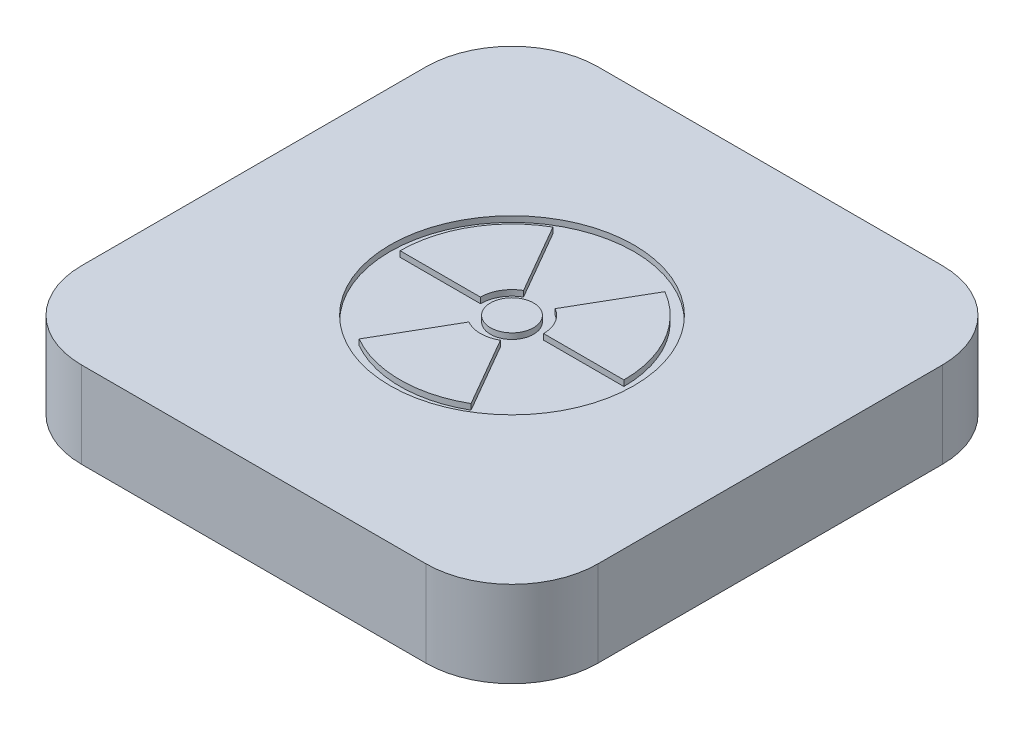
ISO-10303-21;
HEADER;
FILE_DESCRIPTION(('STEP AP214'),'2;1');
FILE_NAME('part.step','',(''),(''),'','','');
FILE_SCHEMA(('AUTOMOTIVE_DESIGN { 1 0 10303 214 1 1 1 1 }'));
ENDSEC;
DATA;
#1=APPLICATION_CONTEXT('core data for automotive mechanical design processes');
#2=APPLICATION_PROTOCOL_DEFINITION('international standard','automotive_design',2000,#1);
#3=PRODUCT_CONTEXT('',#1,'mechanical');
#4=PRODUCT('Part','Part','',(#3));
#5=PRODUCT_RELATED_PRODUCT_CATEGORY('part','',(#4));
#6=PRODUCT_DEFINITION_FORMATION('','',#4);
#7=PRODUCT_DEFINITION_CONTEXT('part definition',#1,'design');
#8=PRODUCT_DEFINITION('design','',#6,#7);
#9=PRODUCT_DEFINITION_SHAPE('','',#8);
#10=(LENGTH_UNIT() NAMED_UNIT(*) SI_UNIT(.MILLI.,.METRE.));
#11=(NAMED_UNIT(*) PLANE_ANGLE_UNIT() SI_UNIT($,.RADIAN.));
#12=(NAMED_UNIT(*) SI_UNIT($,.STERADIAN.) SOLID_ANGLE_UNIT());
#13=UNCERTAINTY_MEASURE_WITH_UNIT(LENGTH_MEASURE(1.E-05),#10,'distance_accuracy_value','');
#14=(GEOMETRIC_REPRESENTATION_CONTEXT(3) GLOBAL_UNCERTAINTY_ASSIGNED_CONTEXT((#13)) GLOBAL_UNIT_ASSIGNED_CONTEXT((#10,
#11,#12)) REPRESENTATION_CONTEXT('',''));
#15=CARTESIAN_POINT('',(0.,0.,0.));
#16=DIRECTION('',(0.,0.,1.));
#17=DIRECTION('',(1.,0.,0.));
#18=AXIS2_PLACEMENT_3D('',#15,#16,#17);
#19=CARTESIAN_POINT('',(-90.,180.,-85.));
#20=DIRECTION('',(0.,0.,1.));
#21=DIRECTION('',(1.,0.,0.));
#22=AXIS2_PLACEMENT_3D('',#19,#20,#21);
#23=PLANE('',#22);
#24=CARTESIAN_POINT('',(-12.5,154.,-85.));
#25=DIRECTION('',(0.,0.,1.));
#26=DIRECTION('',(1.,0.,0.));
#27=AXIS2_PLACEMENT_3D('',#24,#25,#26);
#28=CIRCLE('',#27,0.999999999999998);
#29=CARTESIAN_POINT('',(-11.5,154.,-85.));
#30=VERTEX_POINT('',#29);
#31=EDGE_CURVE('E663',#30,#30,#28,.F.);
#32=ORIENTED_EDGE('',*,*,#31,.T.);
#33=EDGE_LOOP('',(#32));
#34=FACE_BOUND('',#33,.T.);
#35=DIRECTION('',(0.,-1.,0.));
#36=VECTOR('',#35,1.);
#37=CARTESIAN_POINT('',(-6.,182.165525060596,-85.));
#38=LINE('',#37,#36);
#39=CARTESIAN_POINT('',(-6.,155.710654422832,-85.));
#40=VERTEX_POINT('',#39);
#41=CARTESIAN_POINT('',(-6.,145.,-85.));
#42=VERTEX_POINT('',#41);
#43=EDGE_CURVE('E697',#40,#42,#38,.T.);
#44=ORIENTED_EDGE('',*,*,#43,.F.);
#45=DIRECTION('',(1.,0.,0.));
#46=VECTOR('',#45,1.);
#47=CARTESIAN_POINT('',(-6.99999999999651,155.710654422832,-85.));
#48=LINE('',#47,#46);
#49=CARTESIAN_POINT('',(-6.99999999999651,155.710654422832,-85.));
#50=VERTEX_POINT('',#49);
#51=EDGE_CURVE('E52',#50,#40,#48,.T.);
#52=ORIENTED_EDGE('',*,*,#51,.F.);
#53=DIRECTION('',(0.,-1.,0.));
#54=VECTOR('',#53,1.);
#55=CARTESIAN_POINT('',(-6.99999999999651,158.710654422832,-85.));
#56=LINE('',#55,#54);
#57=CARTESIAN_POINT('',(-6.99999999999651,158.710654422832,-85.));
#58=VERTEX_POINT('',#57);
#59=EDGE_CURVE('E417',#58,#50,#56,.T.);
#60=ORIENTED_EDGE('',*,*,#59,.F.);
#61=DIRECTION('',(-1.,0.,0.));
#62=VECTOR('',#61,1.);
#63=CARTESIAN_POINT('',(-6.99999999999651,158.710654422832,-85.));
#64=LINE('',#63,#62);
#65=CARTESIAN_POINT('',(-6.,158.710654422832,-85.));
#66=VERTEX_POINT('',#65);
#67=EDGE_CURVE('E1582',#66,#58,#64,.T.);
#68=ORIENTED_EDGE('',*,*,#67,.F.);
#69=CARTESIAN_POINT('',(-5.99999999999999,170.,-85.));
#70=VERTEX_POINT('',#69);
#71=EDGE_CURVE('E692',#70,#66,#38,.T.);
#72=ORIENTED_EDGE('',*,*,#71,.F.);
#73=DIRECTION('',(-1.,0.,0.));
#74=VECTOR('',#73,1.);
#75=CARTESIAN_POINT('',(-90.,170.,-85.));
#76=LINE('',#75,#74);
#77=CARTESIAN_POINT('',(-60.,170.,-85.));
#78=VERTEX_POINT('',#77);
#79=EDGE_CURVE('E767',#70,#78,#76,.T.);
#80=ORIENTED_EDGE('',*,*,#79,.T.);
#81=DIRECTION('',(0.,1.,0.));
#82=VECTOR('',#81,1.);
#83=CARTESIAN_POINT('',(-60.,180.,-85.));
#84=LINE('',#83,#82);
#85=CARTESIAN_POINT('',(-60.,145.,-85.));
#86=VERTEX_POINT('',#85);
#87=EDGE_CURVE('E764',#86,#78,#84,.T.);
#88=ORIENTED_EDGE('',*,*,#87,.F.);
#89=DIRECTION('',(1.,0.,0.));
#90=VECTOR('',#89,1.);
#91=CARTESIAN_POINT('',(-60.,145.,-85.));
#92=LINE('',#91,#90);
#93=EDGE_CURVE('E813',#86,#42,#92,.T.);
#94=ORIENTED_EDGE('',*,*,#93,.T.);
#95=EDGE_LOOP('',(#44,#52,#60,#68,#72,#80,#88,#94));
#96=FACE_BOUND('',#95,.T.);
#97=ADVANCED_FACE('F35',(#34,#96),#23,.T.);
#98=CARTESIAN_POINT('',(-60.,170.,60.));
#99=DIRECTION('',(0.,1.,0.));
#100=DIRECTION('',(0.,0.,1.));
#101=AXIS2_PLACEMENT_3D('',#98,#99,#100);
#102=PLANE('',#101);
#103=DIRECTION('',(-1.,0.,0.));
#104=VECTOR('',#103,1.);
#105=CARTESIAN_POINT('',(3.49113099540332E-12,170.,-49.8084766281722));
#106=LINE('',#105,#104);
#107=CARTESIAN_POINT('',(7.00000000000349,170.,-49.8084766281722));
#108=VERTEX_POINT('',#107);
#109=CARTESIAN_POINT('',(6.00000000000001,170.,-49.8084766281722));
#110=VERTEX_POINT('',#109);
#111=EDGE_CURVE('E60',#108,#110,#106,.T.);
#112=ORIENTED_EDGE('',*,*,#111,.F.);
#113=DIRECTION('',(0.,0.,1.));
#114=VECTOR('',#113,1.);
#115=CARTESIAN_POINT('',(7.00000000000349,170.,-49.8084766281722));
#116=LINE('',#115,#114);
#117=CARTESIAN_POINT('',(7.00000000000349,170.,-52.8084766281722));
#118=VERTEX_POINT('',#117);
#119=EDGE_CURVE('E418',#118,#108,#116,.T.);
#120=ORIENTED_EDGE('',*,*,#119,.F.);
#121=DIRECTION('',(1.,0.,0.));
#122=VECTOR('',#121,1.);
#123=CARTESIAN_POINT('',(3.49199835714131E-12,170.,-52.8084766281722));
#124=LINE('',#123,#122);
#125=CARTESIAN_POINT('',(6.,170.,-52.8084766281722));
#126=VERTEX_POINT('',#125);
#127=EDGE_CURVE('E441',#126,#118,#124,.T.);
#128=ORIENTED_EDGE('',*,*,#127,.F.);
#129=DIRECTION('',(0.,0.,1.));
#130=VECTOR('',#129,1.);
#131=CARTESIAN_POINT('',(6.00000000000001,170.,-4.));
#132=LINE('',#131,#130);
#133=CARTESIAN_POINT('',(6.00000000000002,170.,-85.));
#134=VERTEX_POINT('',#133);
#135=EDGE_CURVE('E44',#134,#126,#132,.T.);
#136=ORIENTED_EDGE('',*,*,#135,.F.);
#137=CARTESIAN_POINT('',(60.,170.,-85.));
#138=VERTEX_POINT('',#137);
#139=EDGE_CURVE('E771',#138,#134,#76,.T.);
#140=ORIENTED_EDGE('',*,*,#139,.F.);
#141=CARTESIAN_POINT('',(60.,170.,-60.));
#142=DIRECTION('',(0.,1.,0.));
#143=DIRECTION('',(0.,0.,1.));
#144=AXIS2_PLACEMENT_3D('',#141,#142,#143);
#145=CIRCLE('',#144,25.);
#146=CARTESIAN_POINT('',(85.,170.,-60.));
#147=VERTEX_POINT('',#146);
#148=EDGE_CURVE('E758',#147,#138,#145,.T.);
#149=ORIENTED_EDGE('',*,*,#148,.F.);
#150=DIRECTION('',(0.,0.,-1.));
#151=VECTOR('',#150,1.);
#152=CARTESIAN_POINT('',(85.,170.,90.));
#153=LINE('',#152,#151);
#154=CARTESIAN_POINT('',(85.,170.,60.));
#155=VERTEX_POINT('',#154);
#156=EDGE_CURVE('E755',#155,#147,#153,.T.);
#157=ORIENTED_EDGE('',*,*,#156,.F.);
#158=CARTESIAN_POINT('',(60.,170.,60.));
#159=DIRECTION('',(0.,1.,0.));
#160=DIRECTION('',(0.,0.,1.));
#161=AXIS2_PLACEMENT_3D('',#158,#159,#160);
#162=CIRCLE('',#161,25.);
#163=CARTESIAN_POINT('',(60.,170.,85.));
#164=VERTEX_POINT('',#163);
#165=EDGE_CURVE('E759',#164,#155,#162,.T.);
#166=ORIENTED_EDGE('',*,*,#165,.F.);
#167=DIRECTION('',(1.,0.,0.));
#168=VECTOR('',#167,1.);
#169=CARTESIAN_POINT('',(-90.,170.,85.));
#170=LINE('',#169,#168);
#171=CARTESIAN_POINT('',(19.,170.,85.));
#172=VERTEX_POINT('',#171);
#173=EDGE_CURVE('E791',#172,#164,#170,.T.);
#174=ORIENTED_EDGE('',*,*,#173,.F.);
#175=DIRECTION('',(0.,0.,1.));
#176=VECTOR('',#175,1.);
#177=CARTESIAN_POINT('',(19.,170.,86.));
#178=LINE('',#177,#176);
#179=CARTESIAN_POINT('',(19.,170.,65.9999999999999));
#180=VERTEX_POINT('',#179);
#181=EDGE_CURVE('E711',#180,#172,#178,.T.);
#182=ORIENTED_EDGE('',*,*,#181,.F.);
#183=DIRECTION('',(1.,0.,0.));
#184=VECTOR('',#183,1.);
#185=CARTESIAN_POINT('',(-19.,170.,65.9999999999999));
#186=LINE('',#185,#184);
#187=CARTESIAN_POINT('',(-19.,170.,65.9999999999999));
#188=VERTEX_POINT('',#187);
#189=EDGE_CURVE('E731',#188,#180,#186,.T.);
#190=ORIENTED_EDGE('',*,*,#189,.F.);
#191=DIRECTION('',(0.,0.,-1.));
#192=VECTOR('',#191,1.);
#193=CARTESIAN_POINT('',(-19.,170.,60.));
#194=LINE('',#193,#192);
#195=CARTESIAN_POINT('',(-19.,170.,85.));
#196=VERTEX_POINT('',#195);
#197=EDGE_CURVE('E39',#196,#188,#194,.T.);
#198=ORIENTED_EDGE('',*,*,#197,.F.);
#199=CARTESIAN_POINT('',(-60.,170.,85.));
#200=VERTEX_POINT('',#199);
#201=EDGE_CURVE('E795',#200,#196,#170,.T.);
#202=ORIENTED_EDGE('',*,*,#201,.F.);
#203=CARTESIAN_POINT('',(-60.,170.,60.));
#204=DIRECTION('',(0.,1.,0.));
#205=DIRECTION('',(0.,0.,1.));
#206=AXIS2_PLACEMENT_3D('',#203,#204,#205);
#207=CIRCLE('',#206,25.);
#208=CARTESIAN_POINT('',(-85.,170.,60.));
#209=VERTEX_POINT('',#208);
#210=EDGE_CURVE('E788',#209,#200,#207,.T.);
#211=ORIENTED_EDGE('',*,*,#210,.F.);
#212=DIRECTION('',(0.,0.,1.));
#213=VECTOR('',#212,1.);
#214=CARTESIAN_POINT('',(-85.,170.,90.));
#215=LINE('',#214,#213);
#216=CARTESIAN_POINT('',(-85.,170.,-59.9999999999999));
#217=VERTEX_POINT('',#216);
#218=EDGE_CURVE('E770',#217,#209,#215,.T.);
#219=ORIENTED_EDGE('',*,*,#218,.F.);
#220=CARTESIAN_POINT('',(-60.,170.,-60.));
#221=DIRECTION('',(0.,1.,0.));
#222=DIRECTION('',(0.,0.,1.));
#223=AXIS2_PLACEMENT_3D('',#220,#221,#222);
#224=CIRCLE('',#223,25.);
#225=EDGE_CURVE('E774',#78,#217,#224,.T.);
#226=ORIENTED_EDGE('',*,*,#225,.F.);
#227=ORIENTED_EDGE('',*,*,#79,.F.);
#228=DIRECTION('',(0.,0.,-1.));
#229=VECTOR('',#228,1.);
#230=CARTESIAN_POINT('',(-6.,170.,-4.00000000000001));
#231=LINE('',#230,#229);
#232=CARTESIAN_POINT('',(-6.,170.,-11.));
#233=VERTEX_POINT('',#232);
#234=EDGE_CURVE('E11',#233,#70,#231,.T.);
#235=ORIENTED_EDGE('',*,*,#234,.F.);
#236=DIRECTION('',(1.,0.,0.));
#237=VECTOR('',#236,1.);
#238=CARTESIAN_POINT('',(-23.5,170.,-11.));
#239=LINE('',#238,#237);
#240=CARTESIAN_POINT('',(-23.5,170.,-11.));
#241=VERTEX_POINT('',#240);
#242=EDGE_CURVE('E610',#241,#233,#239,.T.);
#243=ORIENTED_EDGE('',*,*,#242,.F.);
#244=DIRECTION('',(0.,0.,-1.));
#245=VECTOR('',#244,1.);
#246=CARTESIAN_POINT('',(-23.5,170.,11.));
#247=LINE('',#246,#245);
#248=CARTESIAN_POINT('',(-23.5,170.,11.));
#249=VERTEX_POINT('',#248);
#250=EDGE_CURVE('E633',#249,#241,#247,.T.);
#251=ORIENTED_EDGE('',*,*,#250,.F.);
#252=DIRECTION('',(-1.,0.,0.));
#253=VECTOR('',#252,1.);
#254=CARTESIAN_POINT('',(-23.5,170.,11.));
#255=LINE('',#254,#253);
#256=CARTESIAN_POINT('',(23.5,170.,11.));
#257=VERTEX_POINT('',#256);
#258=EDGE_CURVE('E630',#257,#249,#255,.T.);
#259=ORIENTED_EDGE('',*,*,#258,.F.);
#260=DIRECTION('',(0.,0.,1.));
#261=VECTOR('',#260,1.);
#262=CARTESIAN_POINT('',(23.5,170.,11.));
#263=LINE('',#262,#261);
#264=CARTESIAN_POINT('',(23.5,170.,-11.));
#265=VERTEX_POINT('',#264);
#266=EDGE_CURVE('E627',#265,#257,#263,.T.);
#267=ORIENTED_EDGE('',*,*,#266,.F.);
#268=DIRECTION('',(1.,0.,0.));
#269=VECTOR('',#268,1.);
#270=CARTESIAN_POINT('',(6.,170.,-11.));
#271=LINE('',#270,#269);
#272=CARTESIAN_POINT('',(6.,170.,-11.));
#273=VERTEX_POINT('',#272);
#274=EDGE_CURVE('E600',#273,#265,#271,.T.);
#275=ORIENTED_EDGE('',*,*,#274,.F.);
#276=EDGE_CURVE('E605',#110,#273,#132,.T.);
#277=ORIENTED_EDGE('',*,*,#276,.F.);
#278=EDGE_LOOP('',(#112,#120,#128,#136,#140,#149,#157,#166,#174,#182,#190,#198,#202,#211,#219,
#226,#227,#235,#243,#251,#259,#267,#275,#277));
#279=FACE_BOUND('',#278,.T.);
#280=ADVANCED_FACE('F911',(#279),#102,.F.);
#281=CARTESIAN_POINT('',(12.5,154.,-85.));
#282=DIRECTION('',(0.,0.,1.));
#283=DIRECTION('',(1.,0.,0.));
#284=AXIS2_PLACEMENT_3D('',#281,#282,#283);
#285=CIRCLE('',#284,0.999999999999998);
#286=CARTESIAN_POINT('',(13.5,154.,-85.));
#287=VERTEX_POINT('',#286);
#288=EDGE_CURVE('E672',#287,#287,#285,.F.);
#289=ORIENTED_EDGE('',*,*,#288,.T.);
#290=EDGE_LOOP('',(#289));
#291=FACE_BOUND('',#290,.T.);
#292=DIRECTION('',(0.,-1.,0.));
#293=VECTOR('',#292,1.);
#294=CARTESIAN_POINT('',(6.,182.165525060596,-85.));
#295=LINE('',#294,#293);
#296=CARTESIAN_POINT('',(6.,145.,-85.));
#297=VERTEX_POINT('',#296);
#298=EDGE_CURVE('E698',#134,#297,#295,.T.);
#299=ORIENTED_EDGE('',*,*,#298,.T.);
#300=CARTESIAN_POINT('',(60.,145.,-85.));
#301=VERTEX_POINT('',#300);
#302=EDGE_CURVE('E816',#297,#301,#92,.T.);
#303=ORIENTED_EDGE('',*,*,#302,.T.);
#304=DIRECTION('',(0.,1.,0.));
#305=VECTOR('',#304,1.);
#306=CARTESIAN_POINT('',(60.,180.,-85.));
#307=LINE('',#306,#305);
#308=EDGE_CURVE('E761',#138,#301,#307,.F.);
#309=ORIENTED_EDGE('',*,*,#308,.F.);
#310=ORIENTED_EDGE('',*,*,#139,.T.);
#311=EDGE_LOOP('',(#299,#303,#309,#310));
#312=FACE_BOUND('',#311,.T.);
#313=ADVANCED_FACE('F935',(#291,#312),#23,.T.);
#314=CARTESIAN_POINT('',(-90.,180.,85.));
#315=DIRECTION('',(0.,0.,-1.));
#316=DIRECTION('',(-1.,0.,0.));
#317=AXIS2_PLACEMENT_3D('',#314,#315,#316);
#318=PLANE('',#317);
#319=DIRECTION('',(0.,-1.,0.));
#320=VECTOR('',#319,1.);
#321=CARTESIAN_POINT('',(-19.,189.052595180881,85.));
#322=LINE('',#321,#320);
#323=CARTESIAN_POINT('',(-19.,151.,85.));
#324=VERTEX_POINT('',#323);
#325=CARTESIAN_POINT('',(-19.,145.,85.));
#326=VERTEX_POINT('',#325);
#327=EDGE_CURVE('E719',#324,#326,#322,.T.);
#328=ORIENTED_EDGE('',*,*,#327,.T.);
#329=DIRECTION('',(-1.,0.,0.));
#330=VECTOR('',#329,1.);
#331=CARTESIAN_POINT('',(-60.,145.,85.));
#332=LINE('',#331,#330);
#333=CARTESIAN_POINT('',(-60.,145.,85.));
#334=VERTEX_POINT('',#333);
#335=EDGE_CURVE('E808',#326,#334,#332,.T.);
#336=ORIENTED_EDGE('',*,*,#335,.T.);
#337=DIRECTION('',(0.,1.,0.));
#338=VECTOR('',#337,1.);
#339=CARTESIAN_POINT('',(-60.,180.,85.));
#340=LINE('',#339,#338);
#341=EDGE_CURVE('E753',#200,#334,#340,.F.);
#342=ORIENTED_EDGE('',*,*,#341,.F.);
#343=ORIENTED_EDGE('',*,*,#201,.T.);
#344=DIRECTION('',(0.,-1.,0.));
#345=VECTOR('',#344,1.);
#346=CARTESIAN_POINT('',(-19.,180.,85.));
#347=LINE('',#346,#345);
#348=EDGE_CURVE('E745',#196,#324,#347,.T.);
#349=ORIENTED_EDGE('',*,*,#348,.T.);
#350=EDGE_LOOP('',(#328,#336,#342,#343,#349));
#351=FACE_BOUND('',#350,.T.);
#352=ADVANCED_FACE('F944',(#351),#318,.T.);
#353=DIRECTION('',(0.,-1.,0.));
#354=VECTOR('',#353,1.);
#355=CARTESIAN_POINT('',(19.,189.052595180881,85.));
#356=LINE('',#355,#354);
#357=CARTESIAN_POINT('',(19.,151.,85.));
#358=VERTEX_POINT('',#357);
#359=CARTESIAN_POINT('',(19.,145.,85.));
#360=VERTEX_POINT('',#359);
#361=EDGE_CURVE('E723',#358,#360,#356,.T.);
#362=ORIENTED_EDGE('',*,*,#361,.F.);
#363=DIRECTION('',(0.,1.,0.));
#364=VECTOR('',#363,1.);
#365=CARTESIAN_POINT('',(19.,180.,85.));
#366=LINE('',#365,#364);
#367=EDGE_CURVE('E748',#358,#172,#366,.T.);
#368=ORIENTED_EDGE('',*,*,#367,.T.);
#369=ORIENTED_EDGE('',*,*,#173,.T.);
#370=DIRECTION('',(0.,1.,0.));
#371=VECTOR('',#370,1.);
#372=CARTESIAN_POINT('',(60.,180.,85.));
#373=LINE('',#372,#371);
#374=CARTESIAN_POINT('',(60.,145.,85.));
#375=VERTEX_POINT('',#374);
#376=EDGE_CURVE('E779',#375,#164,#373,.T.);
#377=ORIENTED_EDGE('',*,*,#376,.F.);
#378=EDGE_CURVE('E803',#375,#360,#332,.T.);
#379=ORIENTED_EDGE('',*,*,#378,.T.);
#380=EDGE_LOOP('',(#362,#368,#369,#377,#379));
#381=FACE_BOUND('',#380,.T.);
#382=ADVANCED_FACE('F949',(#381),#318,.T.);
#383=CARTESIAN_POINT('',(-60.,145.,60.));
#384=DIRECTION('',(0.,1.,0.));
#385=DIRECTION('',(0.,0.,1.));
#386=AXIS2_PLACEMENT_3D('',#383,#384,#385);
#387=PLANE('',#386);
#388=DIRECTION('',(-1.,0.,0.));
#389=VECTOR('',#388,1.);
#390=CARTESIAN_POINT('',(-90.,145.,90.));
#391=LINE('',#390,#389);
#392=CARTESIAN_POINT('',(60.,145.,90.));
#393=VERTEX_POINT('',#392);
#394=CARTESIAN_POINT('',(-60.,145.,90.));
#395=VERTEX_POINT('',#394);
#396=EDGE_CURVE('E835',#393,#395,#391,.T.);
#397=ORIENTED_EDGE('',*,*,#396,.T.);
#398=CARTESIAN_POINT('',(-60.,145.,60.));
#399=DIRECTION('',(0.,-1.,0.));
#400=DIRECTION('',(0.,0.,-1.));
#401=AXIS2_PLACEMENT_3D('',#398,#399,#400);
#402=CIRCLE('',#401,30.);
#403=CARTESIAN_POINT('',(-90.,145.,60.));
#404=VERTEX_POINT('',#403);
#405=EDGE_CURVE('E829',#404,#395,#402,.F.);
#406=ORIENTED_EDGE('',*,*,#405,.F.);
#407=DIRECTION('',(0.,0.,-1.));
#408=VECTOR('',#407,1.);
#409=CARTESIAN_POINT('',(-90.,145.,90.));
#410=LINE('',#409,#408);
#411=CARTESIAN_POINT('',(-90.,145.,-60.));
#412=VERTEX_POINT('',#411);
#413=EDGE_CURVE('E825',#404,#412,#410,.T.);
#414=ORIENTED_EDGE('',*,*,#413,.T.);
#415=CARTESIAN_POINT('',(-60.,145.,-60.));
#416=DIRECTION('',(0.,-1.,0.));
#417=DIRECTION('',(0.,0.,-1.));
#418=AXIS2_PLACEMENT_3D('',#415,#416,#417);
#419=CIRCLE('',#418,30.);
#420=CARTESIAN_POINT('',(-60.,145.,-90.));
#421=VERTEX_POINT('',#420);
#422=EDGE_CURVE('E783',#421,#412,#419,.F.);
#423=ORIENTED_EDGE('',*,*,#422,.F.);
#424=DIRECTION('',(1.,0.,0.));
#425=VECTOR('',#424,1.);
#426=CARTESIAN_POINT('',(-90.,145.,-90.));
#427=LINE('',#426,#425);
#428=CARTESIAN_POINT('',(60.,145.,-90.));
#429=VERTEX_POINT('',#428);
#430=EDGE_CURVE('E827',#421,#429,#427,.T.);
#431=ORIENTED_EDGE('',*,*,#430,.T.);
#432=CARTESIAN_POINT('',(60.,145.,-60.));
#433=DIRECTION('',(0.,-1.,0.));
#434=DIRECTION('',(0.,0.,-1.));
#435=AXIS2_PLACEMENT_3D('',#432,#433,#434);
#436=CIRCLE('',#435,30.);
#437=CARTESIAN_POINT('',(90.,145.,-60.));
#438=VERTEX_POINT('',#437);
#439=EDGE_CURVE('E832',#438,#429,#436,.F.);
#440=ORIENTED_EDGE('',*,*,#439,.F.);
#441=DIRECTION('',(0.,0.,1.));
#442=VECTOR('',#441,1.);
#443=CARTESIAN_POINT('',(90.,145.,90.));
#444=LINE('',#443,#442);
#445=CARTESIAN_POINT('',(90.,145.,60.));
#446=VERTEX_POINT('',#445);
#447=EDGE_CURVE('E837',#438,#446,#444,.T.);
#448=ORIENTED_EDGE('',*,*,#447,.T.);
#449=CARTESIAN_POINT('',(60.,145.,60.));
#450=DIRECTION('',(0.,-1.,0.));
#451=DIRECTION('',(0.,0.,-1.));
#452=AXIS2_PLACEMENT_3D('',#449,#450,#451);
#453=CIRCLE('',#452,30.);
#454=EDGE_CURVE('E839',#393,#446,#453,.F.);
#455=ORIENTED_EDGE('',*,*,#454,.F.);
#456=EDGE_LOOP('',(#397,#406,#414,#423,#431,#440,#448,#455));
#457=FACE_BOUND('',#456,.T.);
#458=ORIENTED_EDGE('',*,*,#302,.F.);
#459=DIRECTION('',(0.,0.,1.));
#460=VECTOR('',#459,1.);
#461=CARTESIAN_POINT('',(6.,145.,-87.));
#462=LINE('',#461,#460);
#463=CARTESIAN_POINT('',(6.,145.,-87.));
#464=VERTEX_POINT('',#463);
#465=EDGE_CURVE('E684',#464,#297,#462,.T.);
#466=ORIENTED_EDGE('',*,*,#465,.F.);
#467=DIRECTION('',(1.,0.,0.));
#468=VECTOR('',#467,1.);
#469=CARTESIAN_POINT('',(-6.,145.,-87.));
#470=LINE('',#469,#468);
#471=CARTESIAN_POINT('',(-6.,145.,-87.));
#472=VERTEX_POINT('',#471);
#473=EDGE_CURVE('E687',#472,#464,#470,.T.);
#474=ORIENTED_EDGE('',*,*,#473,.F.);
#475=DIRECTION('',(0.,0.,-1.));
#476=VECTOR('',#475,1.);
#477=CARTESIAN_POINT('',(-6.,145.,-87.));
#478=LINE('',#477,#476);
#479=EDGE_CURVE('E679',#42,#472,#478,.T.);
#480=ORIENTED_EDGE('',*,*,#479,.F.);
#481=ORIENTED_EDGE('',*,*,#93,.F.);
#482=CARTESIAN_POINT('',(-60.,145.,-60.));
#483=DIRECTION('',(0.,1.,0.));
#484=DIRECTION('',(0.,0.,1.));
#485=AXIS2_PLACEMENT_3D('',#482,#483,#484);
#486=CIRCLE('',#485,25.);
#487=CARTESIAN_POINT('',(-85.,145.,-60.));
#488=VERTEX_POINT('',#487);
#489=EDGE_CURVE('E750',#86,#488,#486,.T.);
#490=ORIENTED_EDGE('',*,*,#489,.T.);
#491=DIRECTION('',(0.,0.,-1.));
#492=VECTOR('',#491,1.);
#493=CARTESIAN_POINT('',(-85.,145.,60.));
#494=LINE('',#493,#492);
#495=CARTESIAN_POINT('',(-85.,145.,60.));
#496=VERTEX_POINT('',#495);
#497=EDGE_CURVE('E814',#496,#488,#494,.T.);
#498=ORIENTED_EDGE('',*,*,#497,.F.);
#499=CARTESIAN_POINT('',(-60.,145.,60.));
#500=DIRECTION('',(0.,1.,0.));
#501=DIRECTION('',(0.,0.,1.));
#502=AXIS2_PLACEMENT_3D('',#499,#500,#501);
#503=CIRCLE('',#502,25.);
#504=EDGE_CURVE('E809',#496,#334,#503,.T.);
#505=ORIENTED_EDGE('',*,*,#504,.T.);
#506=ORIENTED_EDGE('',*,*,#335,.F.);
#507=DIRECTION('',(0.,0.,-1.));
#508=VECTOR('',#507,1.);
#509=CARTESIAN_POINT('',(-19.,145.,85.));
#510=LINE('',#509,#508);
#511=CARTESIAN_POINT('',(-19.,145.,87.));
#512=VERTEX_POINT('',#511);
#513=EDGE_CURVE('E703',#512,#326,#510,.T.);
#514=ORIENTED_EDGE('',*,*,#513,.F.);
#515=DIRECTION('',(-1.,0.,0.));
#516=VECTOR('',#515,1.);
#517=CARTESIAN_POINT('',(-19.,145.,87.));
#518=LINE('',#517,#516);
#519=CARTESIAN_POINT('',(19.,145.,87.));
#520=VERTEX_POINT('',#519);
#521=EDGE_CURVE('E716',#520,#512,#518,.T.);
#522=ORIENTED_EDGE('',*,*,#521,.F.);
#523=DIRECTION('',(0.,0.,1.));
#524=VECTOR('',#523,1.);
#525=CARTESIAN_POINT('',(19.,145.,85.));
#526=LINE('',#525,#524);
#527=EDGE_CURVE('E713',#360,#520,#526,.T.);
#528=ORIENTED_EDGE('',*,*,#527,.F.);
#529=ORIENTED_EDGE('',*,*,#378,.F.);
#530=CARTESIAN_POINT('',(60.,145.,60.));
#531=DIRECTION('',(0.,1.,0.));
#532=DIRECTION('',(0.,0.,1.));
#533=AXIS2_PLACEMENT_3D('',#530,#531,#532);
#534=CIRCLE('',#533,25.);
#535=CARTESIAN_POINT('',(85.,145.,60.));
#536=VERTEX_POINT('',#535);
#537=EDGE_CURVE('E792',#375,#536,#534,.T.);
#538=ORIENTED_EDGE('',*,*,#537,.T.);
#539=DIRECTION('',(0.,0.,1.));
#540=VECTOR('',#539,1.);
#541=CARTESIAN_POINT('',(85.,145.,60.));
#542=LINE('',#541,#540);
#543=CARTESIAN_POINT('',(85.,145.,-60.));
#544=VERTEX_POINT('',#543);
#545=EDGE_CURVE('E800',#544,#536,#542,.T.);
#546=ORIENTED_EDGE('',*,*,#545,.F.);
#547=CARTESIAN_POINT('',(60.,145.,-60.));
#548=DIRECTION('',(0.,1.,0.));
#549=DIRECTION('',(0.,0.,1.));
#550=AXIS2_PLACEMENT_3D('',#547,#548,#549);
#551=CIRCLE('',#550,25.);
#552=EDGE_CURVE('E812',#544,#301,#551,.T.);
#553=ORIENTED_EDGE('',*,*,#552,.T.);
#554=EDGE_LOOP('',(#458,#466,#474,#480,#481,#490,#498,#505,#506,#514,#522,#528,#529,#538,#546,#553));
#555=FACE_BOUND('',#554,.T.);
#556=ADVANCED_FACE('F957',(#457,#555),#387,.F.);
#557=CARTESIAN_POINT('',(90.,180.,90.));
#558=DIRECTION('',(-1.,0.,0.));
#559=DIRECTION('',(0.,0.,1.));
#560=AXIS2_PLACEMENT_3D('',#557,#558,#559);
#561=PLANE('',#560);
#562=ORIENTED_EDGE('',*,*,#447,.F.);
#563=DIRECTION('',(0.,-1.,0.));
#564=VECTOR('',#563,1.);
#565=CARTESIAN_POINT('',(90.,180.,-60.));
#566=LINE('',#565,#564);
#567=CARTESIAN_POINT('',(90.,175.,-60.));
#568=VERTEX_POINT('',#567);
#569=EDGE_CURVE('E874',#438,#568,#566,.F.);
#570=ORIENTED_EDGE('',*,*,#569,.T.);
#571=DIRECTION('',(0.,0.,-1.));
#572=VECTOR('',#571,1.);
#573=CARTESIAN_POINT('',(90.,175.,60.));
#574=LINE('',#573,#572);
#575=CARTESIAN_POINT('',(90.,175.,60.));
#576=VERTEX_POINT('',#575);
#577=EDGE_CURVE('E851',#576,#568,#574,.T.);
#578=ORIENTED_EDGE('',*,*,#577,.F.);
#579=DIRECTION('',(0.,-1.,0.));
#580=VECTOR('',#579,1.);
#581=CARTESIAN_POINT('',(90.,180.,60.));
#582=LINE('',#581,#580);
#583=EDGE_CURVE('E871',#576,#446,#582,.T.);
#584=ORIENTED_EDGE('',*,*,#583,.T.);
#585=EDGE_LOOP('',(#562,#570,#578,#584));
#586=FACE_BOUND('',#585,.T.);
#587=ADVANCED_FACE('F1635',(#586),#561,.F.);
#588=CARTESIAN_POINT('',(-90.,180.,-90.));
#589=DIRECTION('',(0.,0.,1.));
#590=DIRECTION('',(1.,0.,0.));
#591=AXIS2_PLACEMENT_3D('',#588,#589,#590);
#592=PLANE('',#591);
#593=CARTESIAN_POINT('',(12.5,154.,-90.));
#594=DIRECTION('',(0.,0.,-1.));
#595=DIRECTION('',(-1.,0.,0.));
#596=AXIS2_PLACEMENT_3D('',#593,#594,#595);
#597=CIRCLE('',#596,0.999999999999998);
#598=CARTESIAN_POINT('',(11.5,154.,-90.));
#599=VERTEX_POINT('',#598);
#600=EDGE_CURVE('E675',#599,#599,#597,.T.);
#601=ORIENTED_EDGE('',*,*,#600,.F.);
#602=EDGE_LOOP('',(#601));
#603=FACE_BOUND('',#602,.T.);
#604=CARTESIAN_POINT('',(-12.5,154.,-90.));
#605=DIRECTION('',(0.,0.,-1.));
#606=DIRECTION('',(-1.,0.,0.));
#607=AXIS2_PLACEMENT_3D('',#604,#605,#606);
#608=CIRCLE('',#607,0.999999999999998);
#609=CARTESIAN_POINT('',(-13.5,154.,-90.));
#610=VERTEX_POINT('',#609);
#611=EDGE_CURVE('E676',#610,#610,#608,.T.);
#612=ORIENTED_EDGE('',*,*,#611,.F.);
#613=EDGE_LOOP('',(#612));
#614=FACE_BOUND('',#613,.T.);
#615=ORIENTED_EDGE('',*,*,#430,.F.);
#616=DIRECTION('',(0.,-1.,0.));
#617=VECTOR('',#616,1.);
#618=CARTESIAN_POINT('',(-60.,180.,-90.));
#619=LINE('',#618,#617);
#620=CARTESIAN_POINT('',(-60.,175.,-90.));
#621=VERTEX_POINT('',#620);
#622=EDGE_CURVE('E866',#421,#621,#619,.F.);
#623=ORIENTED_EDGE('',*,*,#622,.T.);
#624=DIRECTION('',(-1.,0.,0.));
#625=VECTOR('',#624,1.);
#626=CARTESIAN_POINT('',(60.,175.,-90.));
#627=LINE('',#626,#625);
#628=CARTESIAN_POINT('',(60.,175.,-90.));
#629=VERTEX_POINT('',#628);
#630=EDGE_CURVE('E857',#629,#621,#627,.T.);
#631=ORIENTED_EDGE('',*,*,#630,.F.);
#632=DIRECTION('',(0.,-1.,0.));
#633=VECTOR('',#632,1.);
#634=CARTESIAN_POINT('',(60.,180.,-90.));
#635=LINE('',#634,#633);
#636=EDGE_CURVE('E868',#629,#429,#635,.T.);
#637=ORIENTED_EDGE('',*,*,#636,.T.);
#638=EDGE_LOOP('',(#615,#623,#631,#637));
#639=FACE_BOUND('',#638,.T.);
#640=ADVANCED_FACE('F1639',(#603,#614,#639),#592,.F.);
#641=CARTESIAN_POINT('',(-90.,180.,90.));
#642=DIRECTION('',(1.,0.,0.));
#643=DIRECTION('',(0.,0.,-1.));
#644=AXIS2_PLACEMENT_3D('',#641,#642,#643);
#645=PLANE('',#644);
#646=ORIENTED_EDGE('',*,*,#413,.F.);
#647=DIRECTION('',(0.,-1.,0.));
#648=VECTOR('',#647,1.);
#649=CARTESIAN_POINT('',(-90.,180.,60.));
#650=LINE('',#649,#648);
#651=CARTESIAN_POINT('',(-90.,175.,60.));
#652=VERTEX_POINT('',#651);
#653=EDGE_CURVE('E883',#404,#652,#650,.F.);
#654=ORIENTED_EDGE('',*,*,#653,.T.);
#655=DIRECTION('',(0.,0.,1.));
#656=VECTOR('',#655,1.);
#657=CARTESIAN_POINT('',(-90.,175.,-59.9999999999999));
#658=LINE('',#657,#656);
#659=CARTESIAN_POINT('',(-90.,175.,-59.9999999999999));
#660=VERTEX_POINT('',#659);
#661=EDGE_CURVE('E863',#660,#652,#658,.T.);
#662=ORIENTED_EDGE('',*,*,#661,.F.);
#663=DIRECTION('',(0.,-1.,0.));
#664=VECTOR('',#663,1.);
#665=CARTESIAN_POINT('',(-90.,180.,-60.));
#666=LINE('',#665,#664);
#667=EDGE_CURVE('E881',#660,#412,#666,.T.);
#668=ORIENTED_EDGE('',*,*,#667,.T.);
#669=EDGE_LOOP('',(#646,#654,#662,#668));
#670=FACE_BOUND('',#669,.T.);
#671=ADVANCED_FACE('F1647',(#670),#645,.F.);
#672=CARTESIAN_POINT('',(-90.,180.,90.));
#673=DIRECTION('',(0.,0.,-1.));
#674=DIRECTION('',(-1.,0.,0.));
#675=AXIS2_PLACEMENT_3D('',#672,#673,#674);
#676=PLANE('',#675);
#677=ORIENTED_EDGE('',*,*,#396,.F.);
#678=DIRECTION('',(0.,-1.,0.));
#679=VECTOR('',#678,1.);
#680=CARTESIAN_POINT('',(60.,180.,90.));
#681=LINE('',#680,#679);
#682=CARTESIAN_POINT('',(60.,175.,90.));
#683=VERTEX_POINT('',#682);
#684=EDGE_CURVE('E879',#393,#683,#681,.F.);
#685=ORIENTED_EDGE('',*,*,#684,.T.);
#686=DIRECTION('',(1.,0.,0.));
#687=VECTOR('',#686,1.);
#688=CARTESIAN_POINT('',(-60.,175.,90.));
#689=LINE('',#688,#687);
#690=CARTESIAN_POINT('',(-60.,175.,90.));
#691=VERTEX_POINT('',#690);
#692=EDGE_CURVE('E845',#691,#683,#689,.T.);
#693=ORIENTED_EDGE('',*,*,#692,.F.);
#694=DIRECTION('',(0.,-1.,0.));
#695=VECTOR('',#694,1.);
#696=CARTESIAN_POINT('',(-60.,180.,90.));
#697=LINE('',#696,#695);
#698=EDGE_CURVE('E876',#691,#395,#697,.T.);
#699=ORIENTED_EDGE('',*,*,#698,.T.);
#700=EDGE_LOOP('',(#677,#685,#693,#699));
#701=FACE_BOUND('',#700,.T.);
#702=ADVANCED_FACE('F1643',(#701),#676,.F.);
#703=CARTESIAN_POINT('',(60.,180.,-60.));
#704=DIRECTION('',(0.,-1.,0.));
#705=DIRECTION('',(0.,0.,-1.));
#706=AXIS2_PLACEMENT_3D('',#703,#704,#705);
#707=CYLINDRICAL_SURFACE('',#706,30.);
#708=ORIENTED_EDGE('',*,*,#569,.F.);
#709=ORIENTED_EDGE('',*,*,#439,.T.);
#710=ORIENTED_EDGE('',*,*,#636,.F.);
#711=CARTESIAN_POINT('',(60.,175.,-60.));
#712=DIRECTION('',(0.,1.,0.));
#713=DIRECTION('',(0.,0.,1.));
#714=AXIS2_PLACEMENT_3D('',#711,#712,#713);
#715=CIRCLE('',#714,30.);
#716=EDGE_CURVE('E854',#568,#629,#715,.T.);
#717=ORIENTED_EDGE('',*,*,#716,.F.);
#718=EDGE_LOOP('',(#708,#709,#710,#717));
#719=FACE_BOUND('',#718,.T.);
#720=ADVANCED_FACE('F1646',(#719),#707,.T.);
#721=CARTESIAN_POINT('',(60.,180.,60.));
#722=DIRECTION('',(0.,-1.,0.));
#723=DIRECTION('',(0.,0.,-1.));
#724=AXIS2_PLACEMENT_3D('',#721,#722,#723);
#725=CYLINDRICAL_SURFACE('',#724,30.);
#726=ORIENTED_EDGE('',*,*,#684,.F.);
#727=ORIENTED_EDGE('',*,*,#454,.T.);
#728=ORIENTED_EDGE('',*,*,#583,.F.);
#729=CARTESIAN_POINT('',(60.,175.,60.));
#730=DIRECTION('',(0.,1.,0.));
#731=DIRECTION('',(0.,0.,1.));
#732=AXIS2_PLACEMENT_3D('',#729,#730,#731);
#733=CIRCLE('',#732,30.);
#734=EDGE_CURVE('E848',#683,#576,#733,.T.);
#735=ORIENTED_EDGE('',*,*,#734,.F.);
#736=EDGE_LOOP('',(#726,#727,#728,#735));
#737=FACE_BOUND('',#736,.T.);
#738=ADVANCED_FACE('F1656',(#737),#725,.T.);
#739=CARTESIAN_POINT('',(-60.,180.,60.));
#740=DIRECTION('',(0.,-1.,0.));
#741=DIRECTION('',(0.,0.,-1.));
#742=AXIS2_PLACEMENT_3D('',#739,#740,#741);
#743=CYLINDRICAL_SURFACE('',#742,30.);
#744=ORIENTED_EDGE('',*,*,#653,.F.);
#745=ORIENTED_EDGE('',*,*,#405,.T.);
#746=ORIENTED_EDGE('',*,*,#698,.F.);
#747=CARTESIAN_POINT('',(-60.,175.,60.));
#748=DIRECTION('',(0.,1.,0.));
#749=DIRECTION('',(0.,0.,1.));
#750=AXIS2_PLACEMENT_3D('',#747,#748,#749);
#751=CIRCLE('',#750,30.);
#752=EDGE_CURVE('E842',#652,#691,#751,.T.);
#753=ORIENTED_EDGE('',*,*,#752,.F.);
#754=EDGE_LOOP('',(#744,#745,#746,#753));
#755=FACE_BOUND('',#754,.T.);
#756=ADVANCED_FACE('F1023',(#755),#743,.T.);
#757=CARTESIAN_POINT('',(-60.,180.,-60.));
#758=DIRECTION('',(0.,-1.,0.));
#759=DIRECTION('',(0.,0.,-1.));
#760=AXIS2_PLACEMENT_3D('',#757,#758,#759);
#761=CYLINDRICAL_SURFACE('',#760,30.);
#762=ORIENTED_EDGE('',*,*,#622,.F.);
#763=ORIENTED_EDGE('',*,*,#422,.T.);
#764=ORIENTED_EDGE('',*,*,#667,.F.);
#765=CARTESIAN_POINT('',(-60.,175.,-60.));
#766=DIRECTION('',(0.,1.,0.));
#767=DIRECTION('',(0.,0.,1.));
#768=AXIS2_PLACEMENT_3D('',#765,#766,#767);
#769=CIRCLE('',#768,30.);
#770=EDGE_CURVE('E860',#621,#660,#769,.T.);
#771=ORIENTED_EDGE('',*,*,#770,.F.);
#772=EDGE_LOOP('',(#762,#763,#764,#771));
#773=FACE_BOUND('',#772,.T.);
#774=ADVANCED_FACE('F37',(#773),#761,.T.);
#775=CARTESIAN_POINT('',(-60.,175.,60.));
#776=DIRECTION('',(0.,1.,0.));
#777=DIRECTION('',(0.,0.,1.));
#778=AXIS2_PLACEMENT_3D('',#775,#776,#777);
#779=PLANE('',#778);
#780=CARTESIAN_POINT('',(0.,175.,0.));
#781=DIRECTION('',(0.,1.,0.));
#782=DIRECTION('',(0.,0.,1.));
#783=AXIS2_PLACEMENT_3D('',#780,#781,#782);
#784=CIRCLE('',#783,42.5);
#785=CARTESIAN_POINT('',(0.,175.,42.5));
#786=VERTEX_POINT('',#785);
#787=EDGE_CURVE('E557',#786,#786,#784,.T.);
#788=ORIENTED_EDGE('',*,*,#787,.F.);
#789=EDGE_LOOP('',(#788));
#790=FACE_BOUND('',#789,.T.);
#791=ORIENTED_EDGE('',*,*,#752,.T.);
#792=ORIENTED_EDGE('',*,*,#692,.T.);
#793=ORIENTED_EDGE('',*,*,#734,.T.);
#794=ORIENTED_EDGE('',*,*,#577,.T.);
#795=ORIENTED_EDGE('',*,*,#716,.T.);
#796=ORIENTED_EDGE('',*,*,#630,.T.);
#797=ORIENTED_EDGE('',*,*,#770,.T.);
#798=ORIENTED_EDGE('',*,*,#661,.T.);
#799=EDGE_LOOP('',(#791,#792,#793,#794,#795,#796,#797,#798));
#800=FACE_BOUND('',#799,.T.);
#801=ADVANCED_FACE('F1010',(#790,#800),#779,.T.);
#802=CARTESIAN_POINT('',(85.,180.,90.));
#803=DIRECTION('',(-1.,0.,0.));
#804=DIRECTION('',(0.,0.,1.));
#805=AXIS2_PLACEMENT_3D('',#802,#803,#804);
#806=PLANE('',#805);
#807=ORIENTED_EDGE('',*,*,#545,.T.);
#808=DIRECTION('',(0.,1.,0.));
#809=VECTOR('',#808,1.);
#810=CARTESIAN_POINT('',(85.,180.,60.));
#811=LINE('',#810,#809);
#812=EDGE_CURVE('E754',#155,#536,#811,.F.);
#813=ORIENTED_EDGE('',*,*,#812,.F.);
#814=ORIENTED_EDGE('',*,*,#156,.T.);
#815=DIRECTION('',(0.,1.,0.));
#816=VECTOR('',#815,1.);
#817=CARTESIAN_POINT('',(85.,180.,-60.));
#818=LINE('',#817,#816);
#819=EDGE_CURVE('E751',#544,#147,#818,.T.);
#820=ORIENTED_EDGE('',*,*,#819,.F.);
#821=EDGE_LOOP('',(#807,#813,#814,#820));
#822=FACE_BOUND('',#821,.T.);
#823=ADVANCED_FACE('F964',(#822),#806,.T.);
#824=CARTESIAN_POINT('',(-85.,180.,90.));
#825=DIRECTION('',(1.,0.,0.));
#826=DIRECTION('',(0.,0.,-1.));
#827=AXIS2_PLACEMENT_3D('',#824,#825,#826);
#828=PLANE('',#827);
#829=ORIENTED_EDGE('',*,*,#497,.T.);
#830=DIRECTION('',(0.,1.,0.));
#831=VECTOR('',#830,1.);
#832=CARTESIAN_POINT('',(-85.,180.,-59.9999999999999));
#833=LINE('',#832,#831);
#834=EDGE_CURVE('E775',#217,#488,#833,.F.);
#835=ORIENTED_EDGE('',*,*,#834,.F.);
#836=ORIENTED_EDGE('',*,*,#218,.T.);
#837=DIRECTION('',(0.,1.,0.));
#838=VECTOR('',#837,1.);
#839=CARTESIAN_POINT('',(-85.,180.,60.));
#840=LINE('',#839,#838);
#841=EDGE_CURVE('E778',#496,#209,#840,.T.);
#842=ORIENTED_EDGE('',*,*,#841,.F.);
#843=EDGE_LOOP('',(#829,#835,#836,#842));
#844=FACE_BOUND('',#843,.T.);
#845=ADVANCED_FACE('F1009',(#844),#828,.T.);
#846=CARTESIAN_POINT('',(60.,180.,-60.));
#847=DIRECTION('',(0.,-1.,0.));
#848=DIRECTION('',(0.,0.,-1.));
#849=AXIS2_PLACEMENT_3D('',#846,#847,#848);
#850=CYLINDRICAL_SURFACE('',#849,25.);
#851=ORIENTED_EDGE('',*,*,#819,.T.);
#852=ORIENTED_EDGE('',*,*,#148,.T.);
#853=ORIENTED_EDGE('',*,*,#308,.T.);
#854=ORIENTED_EDGE('',*,*,#552,.F.);
#855=EDGE_LOOP('',(#851,#852,#853,#854));
#856=FACE_BOUND('',#855,.T.);
#857=ADVANCED_FACE('F962',(#856),#850,.F.);
#858=CARTESIAN_POINT('',(60.,180.,60.));
#859=DIRECTION('',(0.,-1.,0.));
#860=DIRECTION('',(0.,0.,-1.));
#861=AXIS2_PLACEMENT_3D('',#858,#859,#860);
#862=CYLINDRICAL_SURFACE('',#861,25.);
#863=ORIENTED_EDGE('',*,*,#376,.T.);
#864=ORIENTED_EDGE('',*,*,#165,.T.);
#865=ORIENTED_EDGE('',*,*,#812,.T.);
#866=ORIENTED_EDGE('',*,*,#537,.F.);
#867=EDGE_LOOP('',(#863,#864,#865,#866));
#868=FACE_BOUND('',#867,.T.);
#869=ADVANCED_FACE('F970',(#868),#862,.F.);
#870=CARTESIAN_POINT('',(-60.,180.,60.));
#871=DIRECTION('',(0.,-1.,0.));
#872=DIRECTION('',(0.,0.,-1.));
#873=AXIS2_PLACEMENT_3D('',#870,#871,#872);
#874=CYLINDRICAL_SURFACE('',#873,25.);
#875=ORIENTED_EDGE('',*,*,#841,.T.);
#876=ORIENTED_EDGE('',*,*,#210,.T.);
#877=ORIENTED_EDGE('',*,*,#341,.T.);
#878=ORIENTED_EDGE('',*,*,#504,.F.);
#879=EDGE_LOOP('',(#875,#876,#877,#878));
#880=FACE_BOUND('',#879,.T.);
#881=ADVANCED_FACE('F1620',(#880),#874,.F.);
#882=CARTESIAN_POINT('',(-60.,180.,-60.));
#883=DIRECTION('',(0.,-1.,0.));
#884=DIRECTION('',(0.,0.,-1.));
#885=AXIS2_PLACEMENT_3D('',#882,#883,#884);
#886=CYLINDRICAL_SURFACE('',#885,25.);
#887=ORIENTED_EDGE('',*,*,#87,.T.);
#888=ORIENTED_EDGE('',*,*,#225,.T.);
#889=ORIENTED_EDGE('',*,*,#834,.T.);
#890=ORIENTED_EDGE('',*,*,#489,.F.);
#891=EDGE_LOOP('',(#887,#888,#889,#890));
#892=FACE_BOUND('',#891,.T.);
#893=ADVANCED_FACE('F1005',(#892),#886,.F.);
#894=CARTESIAN_POINT('',(19.,151.,86.));
#895=DIRECTION('',(-1.,0.,0.));
#896=DIRECTION('',(0.,0.,1.));
#897=AXIS2_PLACEMENT_3D('',#894,#895,#896);
#898=PLANE('',#897);
#899=ORIENTED_EDGE('',*,*,#367,.F.);
#900=DIRECTION('',(0.,0.,1.));
#901=VECTOR('',#900,1.);
#902=CARTESIAN_POINT('',(19.,151.,86.));
#903=LINE('',#902,#901);
#904=CARTESIAN_POINT('',(19.,151.,65.9999999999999));
#905=VERTEX_POINT('',#904);
#906=EDGE_CURVE('E727',#905,#358,#903,.T.);
#907=ORIENTED_EDGE('',*,*,#906,.F.);
#908=DIRECTION('',(0.,1.,0.));
#909=VECTOR('',#908,1.);
#910=CARTESIAN_POINT('',(19.,151.,65.9999999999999));
#911=LINE('',#910,#909);
#912=EDGE_CURVE('E735',#905,#180,#911,.T.);
#913=ORIENTED_EDGE('',*,*,#912,.T.);
#914=ORIENTED_EDGE('',*,*,#181,.T.);
#915=EDGE_LOOP('',(#899,#907,#913,#914));
#916=FACE_BOUND('',#915,.T.);
#917=ADVANCED_FACE('F985',(#916),#898,.F.);
#918=CARTESIAN_POINT('',(-19.,151.,86.));
#919=DIRECTION('',(1.,0.,0.));
#920=DIRECTION('',(0.,0.,-1.));
#921=AXIS2_PLACEMENT_3D('',#918,#919,#920);
#922=PLANE('',#921);
#923=ORIENTED_EDGE('',*,*,#348,.F.);
#924=ORIENTED_EDGE('',*,*,#197,.T.);
#925=DIRECTION('',(0.,1.,0.));
#926=VECTOR('',#925,1.);
#927=CARTESIAN_POINT('',(-19.,151.,65.9999999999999));
#928=LINE('',#927,#926);
#929=CARTESIAN_POINT('',(-19.,151.,65.9999999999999));
#930=VERTEX_POINT('',#929);
#931=EDGE_CURVE('E742',#930,#188,#928,.T.);
#932=ORIENTED_EDGE('',*,*,#931,.F.);
#933=DIRECTION('',(0.,0.,-1.));
#934=VECTOR('',#933,1.);
#935=CARTESIAN_POINT('',(-19.,151.,86.));
#936=LINE('',#935,#934);
#937=EDGE_CURVE('E730',#324,#930,#936,.T.);
#938=ORIENTED_EDGE('',*,*,#937,.F.);
#939=EDGE_LOOP('',(#923,#924,#932,#938));
#940=FACE_BOUND('',#939,.T.);
#941=ADVANCED_FACE('F997',(#940),#922,.F.);
#942=CARTESIAN_POINT('',(-19.,151.,65.9999999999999));
#943=DIRECTION('',(0.,0.,1.));
#944=DIRECTION('',(1.,0.,0.));
#945=AXIS2_PLACEMENT_3D('',#942,#943,#944);
#946=PLANE('',#945);
#947=ORIENTED_EDGE('',*,*,#189,.T.);
#948=ORIENTED_EDGE('',*,*,#912,.F.);
#949=DIRECTION('',(1.,0.,0.));
#950=VECTOR('',#949,1.);
#951=CARTESIAN_POINT('',(-19.,151.,65.9999999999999));
#952=LINE('',#951,#950);
#953=EDGE_CURVE('E733',#930,#905,#952,.T.);
#954=ORIENTED_EDGE('',*,*,#953,.F.);
#955=ORIENTED_EDGE('',*,*,#931,.T.);
#956=EDGE_LOOP('',(#947,#948,#954,#955));
#957=FACE_BOUND('',#956,.T.);
#958=ADVANCED_FACE('F994',(#957),#946,.F.);
#959=CARTESIAN_POINT('',(0.,151.,0.));
#960=DIRECTION('',(0.,-1.,0.));
#961=DIRECTION('',(0.,0.,-1.));
#962=AXIS2_PLACEMENT_3D('',#959,#960,#961);
#963=PLANE('',#962);
#964=CARTESIAN_POINT('',(-12.5,151.,76.));
#965=DIRECTION('',(0.,-1.,0.));
#966=DIRECTION('',(0.,0.,-1.));
#967=AXIS2_PLACEMENT_3D('',#964,#965,#966);
#968=CIRCLE('',#967,1.);
#969=CARTESIAN_POINT('',(-12.5,151.,75.));
#970=VERTEX_POINT('',#969);
#971=EDGE_CURVE('E664',#970,#970,#968,.T.);
#972=ORIENTED_EDGE('',*,*,#971,.F.);
#973=EDGE_LOOP('',(#972));
#974=FACE_BOUND('',#973,.T.);
#975=CARTESIAN_POINT('',(12.5,151.,76.));
#976=DIRECTION('',(0.,-1.,0.));
#977=DIRECTION('',(0.,0.,-1.));
#978=AXIS2_PLACEMENT_3D('',#975,#976,#977);
#979=CIRCLE('',#978,1.);
#980=CARTESIAN_POINT('',(12.5,151.,75.));
#981=VERTEX_POINT('',#980);
#982=EDGE_CURVE('E659',#981,#981,#979,.T.);
#983=ORIENTED_EDGE('',*,*,#982,.F.);
#984=EDGE_LOOP('',(#983));
#985=FACE_BOUND('',#984,.T.);
#986=ORIENTED_EDGE('',*,*,#906,.T.);
#987=DIRECTION('',(0.,0.,-1.));
#988=VECTOR('',#987,1.);
#989=CARTESIAN_POINT('',(19.,151.,85.));
#990=LINE('',#989,#988);
#991=CARTESIAN_POINT('',(19.,151.,87.));
#992=VERTEX_POINT('',#991);
#993=EDGE_CURVE('E704',#992,#358,#990,.T.);
#994=ORIENTED_EDGE('',*,*,#993,.F.);
#995=DIRECTION('',(1.,0.,0.));
#996=VECTOR('',#995,1.);
#997=CARTESIAN_POINT('',(-19.,151.,87.));
#998=LINE('',#997,#996);
#999=CARTESIAN_POINT('',(-19.,151.,87.));
#1000=VERTEX_POINT('',#999);
#1001=EDGE_CURVE('E706',#1000,#992,#998,.T.);
#1002=ORIENTED_EDGE('',*,*,#1001,.F.);
#1003=DIRECTION('',(0.,0.,1.));
#1004=VECTOR('',#1003,1.);
#1005=CARTESIAN_POINT('',(-19.,151.,85.));
#1006=LINE('',#1005,#1004);
#1007=EDGE_CURVE('E709',#324,#1000,#1006,.T.);
#1008=ORIENTED_EDGE('',*,*,#1007,.F.);
#1009=ORIENTED_EDGE('',*,*,#937,.T.);
#1010=ORIENTED_EDGE('',*,*,#953,.T.);
#1011=EDGE_LOOP('',(#986,#994,#1002,#1008,#1009,#1010));
#1012=FACE_BOUND('',#1011,.T.);
#1013=ADVANCED_FACE('F987',(#974,#985,#1012),#963,.T.);
#1014=CARTESIAN_POINT('',(-19.,189.052595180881,85.));
#1015=DIRECTION('',(-1.,0.,0.));
#1016=DIRECTION('',(0.,0.,1.));
#1017=AXIS2_PLACEMENT_3D('',#1014,#1015,#1016);
#1018=PLANE('',#1017);
#1019=ORIENTED_EDGE('',*,*,#1007,.T.);
#1020=DIRECTION('',(0.,-1.,0.));
#1021=VECTOR('',#1020,1.);
#1022=CARTESIAN_POINT('',(-19.,189.052595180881,87.));
#1023=LINE('',#1022,#1021);
#1024=EDGE_CURVE('E707',#1000,#512,#1023,.T.);
#1025=ORIENTED_EDGE('',*,*,#1024,.T.);
#1026=ORIENTED_EDGE('',*,*,#513,.T.);
#1027=ORIENTED_EDGE('',*,*,#327,.F.);
#1028=EDGE_LOOP('',(#1019,#1025,#1026,#1027));
#1029=FACE_BOUND('',#1028,.T.);
#1030=ADVANCED_FACE('F1187',(#1029),#1018,.F.);
#1031=CARTESIAN_POINT('',(-19.,189.052595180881,87.));
#1032=DIRECTION('',(0.,0.,1.));
#1033=DIRECTION('',(1.,0.,0.));
#1034=AXIS2_PLACEMENT_3D('',#1031,#1032,#1033);
#1035=PLANE('',#1034);
#1036=ORIENTED_EDGE('',*,*,#1001,.T.);
#1037=DIRECTION('',(0.,-1.,0.));
#1038=VECTOR('',#1037,1.);
#1039=CARTESIAN_POINT('',(19.,189.052595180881,87.));
#1040=LINE('',#1039,#1038);
#1041=EDGE_CURVE('E721',#992,#520,#1040,.T.);
#1042=ORIENTED_EDGE('',*,*,#1041,.T.);
#1043=ORIENTED_EDGE('',*,*,#521,.T.);
#1044=ORIENTED_EDGE('',*,*,#1024,.F.);
#1045=EDGE_LOOP('',(#1036,#1042,#1043,#1044));
#1046=FACE_BOUND('',#1045,.T.);
#1047=ADVANCED_FACE('F1184',(#1046),#1035,.F.);
#1048=CARTESIAN_POINT('',(19.,189.052595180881,85.));
#1049=DIRECTION('',(1.,0.,0.));
#1050=DIRECTION('',(0.,0.,-1.));
#1051=AXIS2_PLACEMENT_3D('',#1048,#1049,#1050);
#1052=PLANE('',#1051);
#1053=ORIENTED_EDGE('',*,*,#993,.T.);
#1054=ORIENTED_EDGE('',*,*,#361,.T.);
#1055=ORIENTED_EDGE('',*,*,#527,.T.);
#1056=ORIENTED_EDGE('',*,*,#1041,.F.);
#1057=EDGE_LOOP('',(#1053,#1054,#1055,#1056));
#1058=FACE_BOUND('',#1057,.T.);
#1059=ADVANCED_FACE('F980',(#1058),#1052,.F.);
#1060=CARTESIAN_POINT('',(-6.,182.165525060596,-87.));
#1061=DIRECTION('',(0.,0.,-1.));
#1062=DIRECTION('',(-1.,0.,0.));
#1063=AXIS2_PLACEMENT_3D('',#1060,#1061,#1062);
#1064=PLANE('',#1063);
#1065=DIRECTION('',(0.,-1.,0.));
#1066=VECTOR('',#1065,1.);
#1067=CARTESIAN_POINT('',(-6.,182.165525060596,-87.));
#1068=LINE('',#1067,#1066);
#1069=CARTESIAN_POINT('',(-5.99999999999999,172.,-87.));
#1070=VERTEX_POINT('',#1069);
#1071=EDGE_CURVE('E695',#1070,#472,#1068,.T.);
#1072=ORIENTED_EDGE('',*,*,#1071,.T.);
#1073=ORIENTED_EDGE('',*,*,#473,.T.);
#1074=DIRECTION('',(0.,-1.,0.));
#1075=VECTOR('',#1074,1.);
#1076=CARTESIAN_POINT('',(6.,182.165525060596,-87.));
#1077=LINE('',#1076,#1075);
#1078=CARTESIAN_POINT('',(6.00000000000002,172.,-87.));
#1079=VERTEX_POINT('',#1078);
#1080=EDGE_CURVE('E686',#1079,#464,#1077,.T.);
#1081=ORIENTED_EDGE('',*,*,#1080,.F.);
#1082=DIRECTION('',(1.,0.,0.));
#1083=VECTOR('',#1082,1.);
#1084=CARTESIAN_POINT('',(-5.99999999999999,172.,-87.));
#1085=LINE('',#1084,#1083);
#1086=EDGE_CURVE('E592',#1070,#1079,#1085,.T.);
#1087=ORIENTED_EDGE('',*,*,#1086,.F.);
#1088=EDGE_LOOP('',(#1072,#1073,#1081,#1087));
#1089=FACE_BOUND('',#1088,.T.);
#1090=ADVANCED_FACE('F1180',(#1089),#1064,.F.);
#1091=CARTESIAN_POINT('',(6.,182.165525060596,-87.));
#1092=DIRECTION('',(1.,0.,0.));
#1093=DIRECTION('',(0.,0.,-1.));
#1094=AXIS2_PLACEMENT_3D('',#1091,#1092,#1093);
#1095=PLANE('',#1094);
#1096=ORIENTED_EDGE('',*,*,#1080,.T.);
#1097=ORIENTED_EDGE('',*,*,#465,.T.);
#1098=ORIENTED_EDGE('',*,*,#298,.F.);
#1099=ORIENTED_EDGE('',*,*,#135,.T.);
#1100=EDGE_CURVE('E604',#126,#110,#132,.T.);
#1101=ORIENTED_EDGE('',*,*,#1100,.T.);
#1102=ORIENTED_EDGE('',*,*,#276,.T.);
#1103=DIRECTION('',(0.,1.,0.));
#1104=VECTOR('',#1103,1.);
#1105=CARTESIAN_POINT('',(6.,160.,-11.));
#1106=LINE('',#1105,#1104);
#1107=CARTESIAN_POINT('',(6.,160.,-11.));
#1108=VERTEX_POINT('',#1107);
#1109=EDGE_CURVE('E624',#1108,#273,#1106,.T.);
#1110=ORIENTED_EDGE('',*,*,#1109,.F.);
#1111=DIRECTION('',(0.,0.,-1.));
#1112=VECTOR('',#1111,1.);
#1113=CARTESIAN_POINT('',(6.,160.,-11.));
#1114=LINE('',#1113,#1112);
#1115=CARTESIAN_POINT('',(6.,160.,-4.));
#1116=VERTEX_POINT('',#1115);
#1117=EDGE_CURVE('E622',#1116,#1108,#1114,.T.);
#1118=ORIENTED_EDGE('',*,*,#1117,.F.);
#1119=DIRECTION('',(0.,1.,0.));
#1120=VECTOR('',#1119,1.);
#1121=CARTESIAN_POINT('',(6.,160.,-4.));
#1122=LINE('',#1121,#1120);
#1123=CARTESIAN_POINT('',(6.00000000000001,172.,-4.));
#1124=VERTEX_POINT('',#1123);
#1125=EDGE_CURVE('E640',#1116,#1124,#1122,.T.);
#1126=ORIENTED_EDGE('',*,*,#1125,.T.);
#1127=DIRECTION('',(0.,0.,1.));
#1128=VECTOR('',#1127,1.);
#1129=CARTESIAN_POINT('',(6.00000000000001,172.,-4.));
#1130=LINE('',#1129,#1128);
#1131=EDGE_CURVE('E595',#1079,#1124,#1130,.T.);
#1132=ORIENTED_EDGE('',*,*,#1131,.F.);
#1133=EDGE_LOOP('',(#1096,#1097,#1098,#1099,#1101,#1102,#1110,#1118,#1126,#1132));
#1134=FACE_BOUND('',#1133,.T.);
#1135=ADVANCED_FACE('F897',(#1134),#1095,.F.);
#1136=CARTESIAN_POINT('',(-6.,182.165525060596,-87.));
#1137=DIRECTION('',(-1.,0.,0.));
#1138=DIRECTION('',(0.,0.,1.));
#1139=AXIS2_PLACEMENT_3D('',#1136,#1137,#1138);
#1140=PLANE('',#1139);
#1141=ORIENTED_EDGE('',*,*,#71,.T.);
#1142=EDGE_CURVE('E696',#66,#40,#38,.T.);
#1143=ORIENTED_EDGE('',*,*,#1142,.T.);
#1144=ORIENTED_EDGE('',*,*,#43,.T.);
#1145=ORIENTED_EDGE('',*,*,#479,.T.);
#1146=ORIENTED_EDGE('',*,*,#1071,.F.);
#1147=DIRECTION('',(0.,0.,-1.));
#1148=VECTOR('',#1147,1.);
#1149=CARTESIAN_POINT('',(-6.,172.,-4.00000000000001));
#1150=LINE('',#1149,#1148);
#1151=CARTESIAN_POINT('',(-6.,172.,-4.00000000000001));
#1152=VERTEX_POINT('',#1151);
#1153=EDGE_CURVE('E587',#1152,#1070,#1150,.T.);
#1154=ORIENTED_EDGE('',*,*,#1153,.F.);
#1155=DIRECTION('',(0.,1.,0.));
#1156=VECTOR('',#1155,1.);
#1157=CARTESIAN_POINT('',(-6.,160.,-4.));
#1158=LINE('',#1157,#1156);
#1159=CARTESIAN_POINT('',(-6.,160.,-4.));
#1160=VERTEX_POINT('',#1159);
#1161=EDGE_CURVE('E642',#1160,#1152,#1158,.T.);
#1162=ORIENTED_EDGE('',*,*,#1161,.F.);
#1163=DIRECTION('',(0.,0.,1.));
#1164=VECTOR('',#1163,1.);
#1165=CARTESIAN_POINT('',(-6.,160.,-11.));
#1166=LINE('',#1165,#1164);
#1167=CARTESIAN_POINT('',(-6.,160.,-11.));
#1168=VERTEX_POINT('',#1167);
#1169=EDGE_CURVE('E618',#1168,#1160,#1166,.T.);
#1170=ORIENTED_EDGE('',*,*,#1169,.F.);
#1171=DIRECTION('',(0.,1.,0.));
#1172=VECTOR('',#1171,1.);
#1173=CARTESIAN_POINT('',(-6.,160.,-11.));
#1174=LINE('',#1173,#1172);
#1175=EDGE_CURVE('E644',#1168,#233,#1174,.T.);
#1176=ORIENTED_EDGE('',*,*,#1175,.T.);
#1177=ORIENTED_EDGE('',*,*,#234,.T.);
#1178=EDGE_LOOP('',(#1141,#1143,#1144,#1145,#1146,#1154,#1162,#1170,#1176,#1177));
#1179=FACE_BOUND('',#1178,.T.);
#1180=ADVANCED_FACE('F1173',(#1179),#1140,.F.);
#1181=CARTESIAN_POINT('',(-12.5,154.,90.001));
#1182=DIRECTION('',(0.,0.,-1.));
#1183=DIRECTION('',(-1.,0.,0.));
#1184=AXIS2_PLACEMENT_3D('',#1181,#1182,#1183);
#1185=CYLINDRICAL_SURFACE('',#1184,0.999999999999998);
#1186=ORIENTED_EDGE('',*,*,#31,.F.);
#1187=EDGE_LOOP('',(#1186));
#1188=FACE_BOUND('',#1187,.T.);
#1189=ORIENTED_EDGE('',*,*,#611,.T.);
#1190=EDGE_LOOP('',(#1189));
#1191=FACE_BOUND('',#1190,.T.);
#1192=ADVANCED_FACE('F1169',(#1188,#1191),#1185,.F.);
#1193=CARTESIAN_POINT('',(12.5,154.,90.001));
#1194=DIRECTION('',(0.,0.,-1.));
#1195=DIRECTION('',(-1.,0.,0.));
#1196=AXIS2_PLACEMENT_3D('',#1193,#1194,#1195);
#1197=CYLINDRICAL_SURFACE('',#1196,0.999999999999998);
#1198=ORIENTED_EDGE('',*,*,#288,.F.);
#1199=EDGE_LOOP('',(#1198));
#1200=FACE_BOUND('',#1199,.T.);
#1201=ORIENTED_EDGE('',*,*,#600,.T.);
#1202=EDGE_LOOP('',(#1201));
#1203=FACE_BOUND('',#1202,.T.);
#1204=ADVANCED_FACE('F1165',(#1200,#1203),#1197,.F.);
#1205=CARTESIAN_POINT('',(12.5,159.,76.));
#1206=DIRECTION('',(0.,-1.,0.));
#1207=DIRECTION('',(0.,0.,-1.));
#1208=AXIS2_PLACEMENT_3D('',#1205,#1206,#1207);
#1209=CYLINDRICAL_SURFACE('',#1208,1.);
#1210=CARTESIAN_POINT('',(12.5,159.,76.));
#1211=DIRECTION('',(0.,-1.,0.));
#1212=DIRECTION('',(0.,0.,-1.));
#1213=AXIS2_PLACEMENT_3D('',#1210,#1211,#1212);
#1214=CIRCLE('',#1213,1.);
#1215=CARTESIAN_POINT('',(12.5,159.,75.));
#1216=VERTEX_POINT('',#1215);
#1217=EDGE_CURVE('E667',#1216,#1216,#1214,.T.);
#1218=ORIENTED_EDGE('',*,*,#1217,.F.);
#1219=EDGE_LOOP('',(#1218));
#1220=FACE_BOUND('',#1219,.T.);
#1221=ORIENTED_EDGE('',*,*,#982,.T.);
#1222=EDGE_LOOP('',(#1221));
#1223=FACE_BOUND('',#1222,.T.);
#1224=ADVANCED_FACE('F1161',(#1220,#1223),#1209,.F.);
#1225=CARTESIAN_POINT('',(12.5,159.,76.));
#1226=DIRECTION('',(0.,-1.,0.));
#1227=DIRECTION('',(0.,0.,-1.));
#1228=AXIS2_PLACEMENT_3D('',#1225,#1226,#1227);
#1229=PLANE('',#1228);
#1230=ORIENTED_EDGE('',*,*,#1217,.T.);
#1231=EDGE_LOOP('',(#1230));
#1232=FACE_BOUND('',#1231,.T.);
#1233=ADVANCED_FACE('F1157',(#1232),#1229,.T.);
#1234=CARTESIAN_POINT('',(-12.5,159.,76.));
#1235=DIRECTION('',(0.,-1.,0.));
#1236=DIRECTION('',(0.,0.,-1.));
#1237=AXIS2_PLACEMENT_3D('',#1234,#1235,#1236);
#1238=CYLINDRICAL_SURFACE('',#1237,1.);
#1239=CARTESIAN_POINT('',(-12.5,159.,76.));
#1240=DIRECTION('',(0.,-1.,0.));
#1241=DIRECTION('',(0.,0.,-1.));
#1242=AXIS2_PLACEMENT_3D('',#1239,#1240,#1241);
#1243=CIRCLE('',#1242,1.);
#1244=CARTESIAN_POINT('',(-12.5,159.,75.));
#1245=VERTEX_POINT('',#1244);
#1246=EDGE_CURVE('E660',#1245,#1245,#1243,.T.);
#1247=ORIENTED_EDGE('',*,*,#1246,.F.);
#1248=EDGE_LOOP('',(#1247));
#1249=FACE_BOUND('',#1248,.T.);
#1250=ORIENTED_EDGE('',*,*,#971,.T.);
#1251=EDGE_LOOP('',(#1250));
#1252=FACE_BOUND('',#1251,.T.);
#1253=ADVANCED_FACE('F1153',(#1249,#1252),#1238,.F.);
#1254=CARTESIAN_POINT('',(-12.5,159.,76.));
#1255=DIRECTION('',(0.,-1.,0.));
#1256=DIRECTION('',(0.,0.,-1.));
#1257=AXIS2_PLACEMENT_3D('',#1254,#1255,#1256);
#1258=PLANE('',#1257);
#1259=ORIENTED_EDGE('',*,*,#1246,.T.);
#1260=EDGE_LOOP('',(#1259));
#1261=FACE_BOUND('',#1260,.T.);
#1262=ADVANCED_FACE('F1149',(#1261),#1258,.T.);
#1263=CARTESIAN_POINT('',(6.,160.,-11.));
#1264=DIRECTION('',(0.,0.,1.));
#1265=DIRECTION('',(1.,0.,0.));
#1266=AXIS2_PLACEMENT_3D('',#1263,#1264,#1265);
#1267=PLANE('',#1266);
#1268=ORIENTED_EDGE('',*,*,#274,.T.);
#1269=DIRECTION('',(0.,1.,0.));
#1270=VECTOR('',#1269,1.);
#1271=CARTESIAN_POINT('',(23.5,160.,-11.));
#1272=LINE('',#1271,#1270);
#1273=CARTESIAN_POINT('',(23.5,160.,-11.));
#1274=VERTEX_POINT('',#1273);
#1275=EDGE_CURVE('E656',#1274,#265,#1272,.T.);
#1276=ORIENTED_EDGE('',*,*,#1275,.F.);
#1277=DIRECTION('',(1.,0.,0.));
#1278=VECTOR('',#1277,1.);
#1279=CARTESIAN_POINT('',(6.,160.,-11.));
#1280=LINE('',#1279,#1278);
#1281=EDGE_CURVE('E606',#1108,#1274,#1280,.T.);
#1282=ORIENTED_EDGE('',*,*,#1281,.F.);
#1283=ORIENTED_EDGE('',*,*,#1109,.T.);
#1284=EDGE_LOOP('',(#1268,#1276,#1282,#1283));
#1285=FACE_BOUND('',#1284,.T.);
#1286=ADVANCED_FACE('F1145',(#1285),#1267,.F.);
#1287=CARTESIAN_POINT('',(23.5,160.,11.));
#1288=DIRECTION('',(-1.,0.,0.));
#1289=DIRECTION('',(0.,0.,1.));
#1290=AXIS2_PLACEMENT_3D('',#1287,#1288,#1289);
#1291=PLANE('',#1290);
#1292=ORIENTED_EDGE('',*,*,#266,.T.);
#1293=DIRECTION('',(0.,1.,0.));
#1294=VECTOR('',#1293,1.);
#1295=CARTESIAN_POINT('',(23.5,160.,11.));
#1296=LINE('',#1295,#1294);
#1297=CARTESIAN_POINT('',(23.5,160.,11.));
#1298=VERTEX_POINT('',#1297);
#1299=EDGE_CURVE('E653',#1298,#257,#1296,.T.);
#1300=ORIENTED_EDGE('',*,*,#1299,.F.);
#1301=DIRECTION('',(0.,0.,1.));
#1302=VECTOR('',#1301,1.);
#1303=CARTESIAN_POINT('',(23.5,160.,11.));
#1304=LINE('',#1303,#1302);
#1305=EDGE_CURVE('E609',#1274,#1298,#1304,.T.);
#1306=ORIENTED_EDGE('',*,*,#1305,.F.);
#1307=ORIENTED_EDGE('',*,*,#1275,.T.);
#1308=EDGE_LOOP('',(#1292,#1300,#1306,#1307));
#1309=FACE_BOUND('',#1308,.T.);
#1310=ADVANCED_FACE('F1141',(#1309),#1291,.F.);
#1311=CARTESIAN_POINT('',(-23.5,160.,11.));
#1312=DIRECTION('',(0.,0.,-1.));
#1313=DIRECTION('',(-1.,0.,0.));
#1314=AXIS2_PLACEMENT_3D('',#1311,#1312,#1313);
#1315=PLANE('',#1314);
#1316=ORIENTED_EDGE('',*,*,#258,.T.);
#1317=DIRECTION('',(0.,1.,0.));
#1318=VECTOR('',#1317,1.);
#1319=CARTESIAN_POINT('',(-23.5,160.,11.));
#1320=LINE('',#1319,#1318);
#1321=CARTESIAN_POINT('',(-23.5,160.,11.));
#1322=VERTEX_POINT('',#1321);
#1323=EDGE_CURVE('E650',#1322,#249,#1320,.T.);
#1324=ORIENTED_EDGE('',*,*,#1323,.F.);
#1325=DIRECTION('',(-1.,0.,0.));
#1326=VECTOR('',#1325,1.);
#1327=CARTESIAN_POINT('',(-23.5,160.,11.));
#1328=LINE('',#1327,#1326);
#1329=EDGE_CURVE('E612',#1298,#1322,#1328,.T.);
#1330=ORIENTED_EDGE('',*,*,#1329,.F.);
#1331=ORIENTED_EDGE('',*,*,#1299,.T.);
#1332=EDGE_LOOP('',(#1316,#1324,#1330,#1331));
#1333=FACE_BOUND('',#1332,.T.);
#1334=ADVANCED_FACE('F1137',(#1333),#1315,.F.);
#1335=CARTESIAN_POINT('',(-23.5,160.,11.));
#1336=DIRECTION('',(1.,0.,0.));
#1337=DIRECTION('',(0.,0.,-1.));
#1338=AXIS2_PLACEMENT_3D('',#1335,#1336,#1337);
#1339=PLANE('',#1338);
#1340=ORIENTED_EDGE('',*,*,#250,.T.);
#1341=DIRECTION('',(0.,1.,0.));
#1342=VECTOR('',#1341,1.);
#1343=CARTESIAN_POINT('',(-23.5,160.,-11.));
#1344=LINE('',#1343,#1342);
#1345=CARTESIAN_POINT('',(-23.5,160.,-11.));
#1346=VERTEX_POINT('',#1345);
#1347=EDGE_CURVE('E647',#1346,#241,#1344,.T.);
#1348=ORIENTED_EDGE('',*,*,#1347,.F.);
#1349=DIRECTION('',(0.,0.,-1.));
#1350=VECTOR('',#1349,1.);
#1351=CARTESIAN_POINT('',(-23.5,160.,11.));
#1352=LINE('',#1351,#1350);
#1353=EDGE_CURVE('E614',#1322,#1346,#1352,.T.);
#1354=ORIENTED_EDGE('',*,*,#1353,.F.);
#1355=ORIENTED_EDGE('',*,*,#1323,.T.);
#1356=EDGE_LOOP('',(#1340,#1348,#1354,#1355));
#1357=FACE_BOUND('',#1356,.T.);
#1358=ADVANCED_FACE('F1133',(#1357),#1339,.F.);
#1359=CARTESIAN_POINT('',(-23.5,160.,-11.));
#1360=DIRECTION('',(0.,0.,1.));
#1361=DIRECTION('',(1.,0.,0.));
#1362=AXIS2_PLACEMENT_3D('',#1359,#1360,#1361);
#1363=PLANE('',#1362);
#1364=ORIENTED_EDGE('',*,*,#242,.T.);
#1365=ORIENTED_EDGE('',*,*,#1175,.F.);
#1366=DIRECTION('',(1.,0.,0.));
#1367=VECTOR('',#1366,1.);
#1368=CARTESIAN_POINT('',(-23.5,160.,-11.));
#1369=LINE('',#1368,#1367);
#1370=EDGE_CURVE('E616',#1346,#1168,#1369,.T.);
#1371=ORIENTED_EDGE('',*,*,#1370,.F.);
#1372=ORIENTED_EDGE('',*,*,#1347,.T.);
#1373=EDGE_LOOP('',(#1364,#1365,#1371,#1372));
#1374=FACE_BOUND('',#1373,.T.);
#1375=ADVANCED_FACE('F1129',(#1374),#1363,.F.);
#1376=CARTESIAN_POINT('',(-6.,160.,-4.));
#1377=DIRECTION('',(0.,0.,1.));
#1378=DIRECTION('',(1.,0.,0.));
#1379=AXIS2_PLACEMENT_3D('',#1376,#1377,#1378);
#1380=PLANE('',#1379);
#1381=ORIENTED_EDGE('',*,*,#1161,.T.);
#1382=DIRECTION('',(-1.,0.,0.));
#1383=VECTOR('',#1382,1.);
#1384=CARTESIAN_POINT('',(-6.,172.,-4.00000000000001));
#1385=LINE('',#1384,#1383);
#1386=EDGE_CURVE('E598',#1124,#1152,#1385,.T.);
#1387=ORIENTED_EDGE('',*,*,#1386,.F.);
#1388=ORIENTED_EDGE('',*,*,#1125,.F.);
#1389=DIRECTION('',(1.,0.,0.));
#1390=VECTOR('',#1389,1.);
#1391=CARTESIAN_POINT('',(-6.,160.,-4.));
#1392=LINE('',#1391,#1390);
#1393=EDGE_CURVE('E620',#1160,#1116,#1392,.T.);
#1394=ORIENTED_EDGE('',*,*,#1393,.F.);
#1395=EDGE_LOOP('',(#1381,#1387,#1388,#1394));
#1396=FACE_BOUND('',#1395,.T.);
#1397=ADVANCED_FACE('F1125',(#1396),#1380,.F.);
#1398=CARTESIAN_POINT('',(0.,160.,0.));
#1399=DIRECTION('',(0.,1.,0.));
#1400=DIRECTION('',(0.,0.,1.));
#1401=AXIS2_PLACEMENT_3D('',#1398,#1399,#1400);
#1402=PLANE('',#1401);
#1403=CARTESIAN_POINT('',(-20.,160.,-7.25));
#1404=DIRECTION('',(0.,-1.,0.));
#1405=DIRECTION('',(0.,0.,-1.));
#1406=AXIS2_PLACEMENT_3D('',#1403,#1404,#1405);
#1407=CIRCLE('',#1406,1.);
#1408=CARTESIAN_POINT('',(-20.,160.,-8.25));
#1409=VERTEX_POINT('',#1408);
#1410=EDGE_CURVE('E563',#1409,#1409,#1407,.T.);
#1411=ORIENTED_EDGE('',*,*,#1410,.F.);
#1412=EDGE_LOOP('',(#1411));
#1413=FACE_BOUND('',#1412,.T.);
#1414=CARTESIAN_POINT('',(20.,160.,-7.25));
#1415=DIRECTION('',(0.,-1.,0.));
#1416=DIRECTION('',(0.,0.,-1.));
#1417=AXIS2_PLACEMENT_3D('',#1414,#1415,#1416);
#1418=CIRCLE('',#1417,1.);
#1419=CARTESIAN_POINT('',(20.,160.,-8.25));
#1420=VERTEX_POINT('',#1419);
#1421=EDGE_CURVE('E576',#1420,#1420,#1418,.T.);
#1422=ORIENTED_EDGE('',*,*,#1421,.F.);
#1423=EDGE_LOOP('',(#1422));
#1424=FACE_BOUND('',#1423,.T.);
#1425=CARTESIAN_POINT('',(20.,160.,7.25));
#1426=DIRECTION('',(0.,-1.,0.));
#1427=DIRECTION('',(0.,0.,-1.));
#1428=AXIS2_PLACEMENT_3D('',#1425,#1426,#1427);
#1429=CIRCLE('',#1428,1.);
#1430=CARTESIAN_POINT('',(20.,160.,6.25));
#1431=VERTEX_POINT('',#1430);
#1432=EDGE_CURVE('E570',#1431,#1431,#1429,.T.);
#1433=ORIENTED_EDGE('',*,*,#1432,.F.);
#1434=EDGE_LOOP('',(#1433));
#1435=FACE_BOUND('',#1434,.T.);
#1436=CARTESIAN_POINT('',(-20.,160.,7.25));
#1437=DIRECTION('',(0.,-1.,0.));
#1438=DIRECTION('',(0.,0.,-1.));
#1439=AXIS2_PLACEMENT_3D('',#1436,#1437,#1438);
#1440=CIRCLE('',#1439,1.);
#1441=CARTESIAN_POINT('',(-20.,160.,6.25));
#1442=VERTEX_POINT('',#1441);
#1443=EDGE_CURVE('E569',#1442,#1442,#1440,.T.);
#1444=ORIENTED_EDGE('',*,*,#1443,.F.);
#1445=EDGE_LOOP('',(#1444));
#1446=FACE_BOUND('',#1445,.T.);
#1447=ORIENTED_EDGE('',*,*,#1281,.T.);
#1448=ORIENTED_EDGE('',*,*,#1305,.T.);
#1449=ORIENTED_EDGE('',*,*,#1329,.T.);
#1450=ORIENTED_EDGE('',*,*,#1353,.T.);
#1451=ORIENTED_EDGE('',*,*,#1370,.T.);
#1452=ORIENTED_EDGE('',*,*,#1169,.T.);
#1453=ORIENTED_EDGE('',*,*,#1393,.T.);
#1454=ORIENTED_EDGE('',*,*,#1117,.T.);
#1455=EDGE_LOOP('',(#1447,#1448,#1449,#1450,#1451,#1452,#1453,#1454));
#1456=FACE_BOUND('',#1455,.T.);
#1457=ADVANCED_FACE('F1121',(#1413,#1424,#1435,#1446,#1456),#1402,.F.);
#1458=CARTESIAN_POINT('',(0.,172.,0.));
#1459=DIRECTION('',(0.,-1.,0.));
#1460=DIRECTION('',(0.,0.,-1.));
#1461=AXIS2_PLACEMENT_3D('',#1458,#1459,#1460);
#1462=PLANE('',#1461);
#1463=ORIENTED_EDGE('',*,*,#1153,.T.);
#1464=ORIENTED_EDGE('',*,*,#1086,.T.);
#1465=ORIENTED_EDGE('',*,*,#1131,.T.);
#1466=ORIENTED_EDGE('',*,*,#1386,.T.);
#1467=EDGE_LOOP('',(#1463,#1464,#1465,#1466));
#1468=FACE_BOUND('',#1467,.T.);
#1469=ADVANCED_FACE('F1117',(#1468),#1462,.T.);
#1470=CARTESIAN_POINT('',(-20.,168.,7.25));
#1471=DIRECTION('',(0.,-1.,0.));
#1472=DIRECTION('',(0.,0.,-1.));
#1473=AXIS2_PLACEMENT_3D('',#1470,#1471,#1472);
#1474=CYLINDRICAL_SURFACE('',#1473,1.);
#1475=CARTESIAN_POINT('',(-20.,168.,7.25));
#1476=DIRECTION('',(0.,-1.,0.));
#1477=DIRECTION('',(0.,0.,-1.));
#1478=AXIS2_PLACEMENT_3D('',#1475,#1476,#1477);
#1479=CIRCLE('',#1478,1.);
#1480=CARTESIAN_POINT('',(-20.,168.,6.25));
#1481=VERTEX_POINT('',#1480);
#1482=EDGE_CURVE('E584',#1481,#1481,#1479,.T.);
#1483=ORIENTED_EDGE('',*,*,#1482,.F.);
#1484=EDGE_LOOP('',(#1483));
#1485=FACE_BOUND('',#1484,.T.);
#1486=ORIENTED_EDGE('',*,*,#1443,.T.);
#1487=EDGE_LOOP('',(#1486));
#1488=FACE_BOUND('',#1487,.T.);
#1489=ADVANCED_FACE('F1113',(#1485,#1488),#1474,.F.);
#1490=CARTESIAN_POINT('',(-20.,168.,7.25));
#1491=DIRECTION('',(0.,-1.,0.));
#1492=DIRECTION('',(0.,0.,-1.));
#1493=AXIS2_PLACEMENT_3D('',#1490,#1491,#1492);
#1494=PLANE('',#1493);
#1495=ORIENTED_EDGE('',*,*,#1482,.T.);
#1496=EDGE_LOOP('',(#1495));
#1497=FACE_BOUND('',#1496,.T.);
#1498=ADVANCED_FACE('F1099',(#1497),#1494,.T.);
#1499=CARTESIAN_POINT('',(20.,168.,7.25));
#1500=DIRECTION('',(0.,-1.,0.));
#1501=DIRECTION('',(0.,0.,-1.));
#1502=AXIS2_PLACEMENT_3D('',#1499,#1500,#1501);
#1503=CYLINDRICAL_SURFACE('',#1502,1.);
#1504=CARTESIAN_POINT('',(20.,168.,7.25));
#1505=DIRECTION('',(0.,-1.,0.));
#1506=DIRECTION('',(0.,0.,-1.));
#1507=AXIS2_PLACEMENT_3D('',#1504,#1505,#1506);
#1508=CIRCLE('',#1507,1.);
#1509=CARTESIAN_POINT('',(20.,168.,6.25));
#1510=VERTEX_POINT('',#1509);
#1511=EDGE_CURVE('E566',#1510,#1510,#1508,.T.);
#1512=ORIENTED_EDGE('',*,*,#1511,.F.);
#1513=EDGE_LOOP('',(#1512));
#1514=FACE_BOUND('',#1513,.T.);
#1515=ORIENTED_EDGE('',*,*,#1432,.T.);
#1516=EDGE_LOOP('',(#1515));
#1517=FACE_BOUND('',#1516,.T.);
#1518=ADVANCED_FACE('F1095',(#1514,#1517),#1503,.F.);
#1519=CARTESIAN_POINT('',(20.,168.,7.25));
#1520=DIRECTION('',(0.,-1.,0.));
#1521=DIRECTION('',(0.,0.,-1.));
#1522=AXIS2_PLACEMENT_3D('',#1519,#1520,#1521);
#1523=PLANE('',#1522);
#1524=ORIENTED_EDGE('',*,*,#1511,.T.);
#1525=EDGE_LOOP('',(#1524));
#1526=FACE_BOUND('',#1525,.T.);
#1527=ADVANCED_FACE('F1091',(#1526),#1523,.T.);
#1528=CARTESIAN_POINT('',(20.,168.,-7.25));
#1529=DIRECTION('',(0.,-1.,0.));
#1530=DIRECTION('',(0.,0.,-1.));
#1531=AXIS2_PLACEMENT_3D('',#1528,#1529,#1530);
#1532=CYLINDRICAL_SURFACE('',#1531,1.);
#1533=CARTESIAN_POINT('',(20.,168.,-7.25));
#1534=DIRECTION('',(0.,-1.,0.));
#1535=DIRECTION('',(0.,0.,-1.));
#1536=AXIS2_PLACEMENT_3D('',#1533,#1534,#1535);
#1537=CIRCLE('',#1536,1.);
#1538=CARTESIAN_POINT('',(20.,168.,-8.25));
#1539=VERTEX_POINT('',#1538);
#1540=EDGE_CURVE('E573',#1539,#1539,#1537,.T.);
#1541=ORIENTED_EDGE('',*,*,#1540,.F.);
#1542=EDGE_LOOP('',(#1541));
#1543=FACE_BOUND('',#1542,.T.);
#1544=ORIENTED_EDGE('',*,*,#1421,.T.);
#1545=EDGE_LOOP('',(#1544));
#1546=FACE_BOUND('',#1545,.T.);
#1547=ADVANCED_FACE('F1094',(#1543,#1546),#1532,.F.);
#1548=CARTESIAN_POINT('',(20.,168.,-7.25));
#1549=DIRECTION('',(0.,-1.,0.));
#1550=DIRECTION('',(0.,0.,-1.));
#1551=AXIS2_PLACEMENT_3D('',#1548,#1549,#1550);
#1552=PLANE('',#1551);
#1553=ORIENTED_EDGE('',*,*,#1540,.T.);
#1554=EDGE_LOOP('',(#1553));
#1555=FACE_BOUND('',#1554,.T.);
#1556=ADVANCED_FACE('F1101',(#1555),#1552,.T.);
#1557=CARTESIAN_POINT('',(-20.,168.,-7.25));
#1558=DIRECTION('',(0.,-1.,0.));
#1559=DIRECTION('',(0.,0.,-1.));
#1560=AXIS2_PLACEMENT_3D('',#1557,#1558,#1559);
#1561=CYLINDRICAL_SURFACE('',#1560,1.);
#1562=CARTESIAN_POINT('',(-20.,168.,-7.25));
#1563=DIRECTION('',(0.,-1.,0.));
#1564=DIRECTION('',(0.,0.,-1.));
#1565=AXIS2_PLACEMENT_3D('',#1562,#1563,#1564);
#1566=CIRCLE('',#1565,1.);
#1567=CARTESIAN_POINT('',(-20.,168.,-8.25));
#1568=VERTEX_POINT('',#1567);
#1569=EDGE_CURVE('E579',#1568,#1568,#1566,.T.);
#1570=ORIENTED_EDGE('',*,*,#1569,.F.);
#1571=EDGE_LOOP('',(#1570));
#1572=FACE_BOUND('',#1571,.T.);
#1573=ORIENTED_EDGE('',*,*,#1410,.T.);
#1574=EDGE_LOOP('',(#1573));
#1575=FACE_BOUND('',#1574,.T.);
#1576=ADVANCED_FACE('F1086',(#1572,#1575),#1561,.F.);
#1577=CARTESIAN_POINT('',(-20.,168.,-7.25));
#1578=DIRECTION('',(0.,-1.,0.));
#1579=DIRECTION('',(0.,0.,-1.));
#1580=AXIS2_PLACEMENT_3D('',#1577,#1578,#1579);
#1581=PLANE('',#1580);
#1582=ORIENTED_EDGE('',*,*,#1569,.T.);
#1583=EDGE_LOOP('',(#1582));
#1584=FACE_BOUND('',#1583,.T.);
#1585=ADVANCED_FACE('F1081',(#1584),#1581,.T.);
#1586=CARTESIAN_POINT('',(0.,173.,0.));
#1587=DIRECTION('',(0.,1.,0.));
#1588=DIRECTION('',(0.,0.,1.));
#1589=AXIS2_PLACEMENT_3D('',#1586,#1587,#1588);
#1590=CYLINDRICAL_SURFACE('',#1589,42.5);
#1591=CARTESIAN_POINT('',(0.,173.,0.));
#1592=DIRECTION('',(0.,1.,0.));
#1593=DIRECTION('',(0.,0.,1.));
#1594=AXIS2_PLACEMENT_3D('',#1591,#1592,#1593);
#1595=CIRCLE('',#1594,42.5);
#1596=CARTESIAN_POINT('',(0.,173.,42.5));
#1597=VERTEX_POINT('',#1596);
#1598=EDGE_CURVE('E560',#1597,#1597,#1595,.T.);
#1599=ORIENTED_EDGE('',*,*,#1598,.F.);
#1600=EDGE_LOOP('',(#1599));
#1601=FACE_BOUND('',#1600,.T.);
#1602=ORIENTED_EDGE('',*,*,#787,.T.);
#1603=EDGE_LOOP('',(#1602));
#1604=FACE_BOUND('',#1603,.T.);
#1605=ADVANCED_FACE('F1069',(#1601,#1604),#1590,.F.);
#1606=CARTESIAN_POINT('',(0.,173.,0.));
#1607=DIRECTION('',(0.,1.,0.));
#1608=DIRECTION('',(0.,0.,1.));
#1609=AXIS2_PLACEMENT_3D('',#1606,#1607,#1608);
#1610=PLANE('',#1609);
#1611=DIRECTION('',(-0.500000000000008,0.,-0.866025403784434));
#1612=VECTOR('',#1611,1.);
#1613=CARTESIAN_POINT('',(-19.5000000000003,173.,-33.7749907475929));
#1614=LINE('',#1613,#1612);
#1615=CARTESIAN_POINT('',(-5.50000000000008,173.,-9.52627944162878));
#1616=VERTEX_POINT('',#1615);
#1617=CARTESIAN_POINT('',(-19.5000000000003,173.,-33.7749907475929));
#1618=VERTEX_POINT('',#1617);
#1619=EDGE_CURVE('E465',#1616,#1618,#1614,.T.);
#1620=ORIENTED_EDGE('',*,*,#1619,.F.);
#1621=CARTESIAN_POINT('',(0.,173.,0.));
#1622=DIRECTION('',(0.,-1.,0.));
#1623=DIRECTION('',(0.,0.,1.));
#1624=AXIS2_PLACEMENT_3D('',#1621,#1622,#1623);
#1625=CIRCLE('',#1624,11.);
#1626=CARTESIAN_POINT('',(-11.,173.,1.23956400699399E-13));
#1627=VERTEX_POINT('',#1626);
#1628=EDGE_CURVE('E462',#1627,#1616,#1625,.T.);
#1629=ORIENTED_EDGE('',*,*,#1628,.F.);
#1630=DIRECTION('',(1.,0.,0.));
#1631=VECTOR('',#1630,1.);
#1632=CARTESIAN_POINT('',(-39.,173.,4.39481784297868E-13));
#1633=LINE('',#1632,#1631);
#1634=CARTESIAN_POINT('',(-39.,173.,4.39481784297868E-13));
#1635=VERTEX_POINT('',#1634);
#1636=EDGE_CURVE('E458',#1635,#1627,#1633,.T.);
#1637=ORIENTED_EDGE('',*,*,#1636,.F.);
#1638=CARTESIAN_POINT('',(0.,173.,0.));
#1639=DIRECTION('',(0.,1.,0.));
#1640=DIRECTION('',(0.,0.,1.));
#1641=AXIS2_PLACEMENT_3D('',#1638,#1639,#1640);
#1642=CIRCLE('',#1641,39.);
#1643=EDGE_CURVE('E455',#1618,#1635,#1642,.T.);
#1644=ORIENTED_EDGE('',*,*,#1643,.F.);
#1645=EDGE_LOOP('',(#1620,#1629,#1637,#1644));
#1646=FACE_BOUND('',#1645,.T.);
#1647=DIRECTION('',(1.,0.,0.));
#1648=VECTOR('',#1647,1.);
#1649=CARTESIAN_POINT('',(11.,173.,-1.23956400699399E-13));
#1650=LINE('',#1649,#1648);
#1651=CARTESIAN_POINT('',(11.,173.,-1.23893467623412E-13));
#1652=VERTEX_POINT('',#1651);
#1653=CARTESIAN_POINT('',(39.,173.,-4.39481784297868E-13));
#1654=VERTEX_POINT('',#1653);
#1655=EDGE_CURVE('E498',#1652,#1654,#1650,.T.);
#1656=ORIENTED_EDGE('',*,*,#1655,.F.);
#1657=CARTESIAN_POINT('',(0.,173.,0.));
#1658=DIRECTION('',(0.,-1.,0.));
#1659=DIRECTION('',(0.,0.,1.));
#1660=AXIS2_PLACEMENT_3D('',#1657,#1658,#1659);
#1661=CIRCLE('',#1660,11.);
#1662=CARTESIAN_POINT('',(5.49999999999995,173.,-9.52627944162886));
#1663=VERTEX_POINT('',#1662);
#1664=EDGE_CURVE('E495',#1663,#1652,#1661,.T.);
#1665=ORIENTED_EDGE('',*,*,#1664,.F.);
#1666=DIRECTION('',(-0.499999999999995,0.,0.866025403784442));
#1667=VECTOR('',#1666,1.);
#1668=CARTESIAN_POINT('',(19.4999999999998,173.,-33.7749907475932));
#1669=LINE('',#1668,#1667);
#1670=CARTESIAN_POINT('',(19.4999999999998,173.,-33.7749907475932));
#1671=VERTEX_POINT('',#1670);
#1672=EDGE_CURVE('E491',#1671,#1663,#1669,.T.);
#1673=ORIENTED_EDGE('',*,*,#1672,.F.);
#1674=CARTESIAN_POINT('',(0.,173.,0.));
#1675=DIRECTION('',(0.,1.,0.));
#1676=DIRECTION('',(0.,0.,1.));
#1677=AXIS2_PLACEMENT_3D('',#1674,#1675,#1676);
#1678=CIRCLE('',#1677,39.);
#1679=EDGE_CURVE('E488',#1654,#1671,#1678,.T.);
#1680=ORIENTED_EDGE('',*,*,#1679,.F.);
#1681=EDGE_LOOP('',(#1656,#1665,#1673,#1680));
#1682=FACE_BOUND('',#1681,.T.);
#1683=DIRECTION('',(-0.500000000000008,0.,-0.866025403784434));
#1684=VECTOR('',#1683,1.);
#1685=CARTESIAN_POINT('',(5.50000000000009,173.,9.52627944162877));
#1686=LINE('',#1685,#1684);
#1687=CARTESIAN_POINT('',(19.5000000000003,173.,33.7749907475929));
#1688=VERTEX_POINT('',#1687);
#1689=CARTESIAN_POINT('',(5.50000000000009,173.,9.52627944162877));
#1690=VERTEX_POINT('',#1689);
#1691=EDGE_CURVE('E531',#1688,#1690,#1686,.T.);
#1692=ORIENTED_EDGE('',*,*,#1691,.F.);
#1693=CARTESIAN_POINT('',(0.,173.,0.));
#1694=DIRECTION('',(0.,1.,0.));
#1695=DIRECTION('',(0.,0.,1.));
#1696=AXIS2_PLACEMENT_3D('',#1693,#1694,#1695);
#1697=CIRCLE('',#1696,39.);
#1698=CARTESIAN_POINT('',(-19.4999999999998,173.,33.7749907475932));
#1699=VERTEX_POINT('',#1698);
#1700=EDGE_CURVE('E528',#1699,#1688,#1697,.T.);
#1701=ORIENTED_EDGE('',*,*,#1700,.F.);
#1702=DIRECTION('',(-0.499999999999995,0.,0.866025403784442));
#1703=VECTOR('',#1702,1.);
#1704=CARTESIAN_POINT('',(-5.49999999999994,173.,9.52627944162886));
#1705=LINE('',#1704,#1703);
#1706=CARTESIAN_POINT('',(-5.49999999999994,173.,9.52627944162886));
#1707=VERTEX_POINT('',#1706);
#1708=EDGE_CURVE('E524',#1707,#1699,#1705,.T.);
#1709=ORIENTED_EDGE('',*,*,#1708,.F.);
#1710=CARTESIAN_POINT('',(0.,173.,0.));
#1711=DIRECTION('',(0.,-1.,0.));
#1712=DIRECTION('',(0.,0.,1.));
#1713=AXIS2_PLACEMENT_3D('',#1710,#1711,#1712);
#1714=CIRCLE('',#1713,11.);
#1715=EDGE_CURVE('E521',#1690,#1707,#1714,.T.);
#1716=ORIENTED_EDGE('',*,*,#1715,.F.);
#1717=EDGE_LOOP('',(#1692,#1701,#1709,#1716));
#1718=FACE_BOUND('',#1717,.T.);
#1719=CARTESIAN_POINT('',(0.,173.,0.));
#1720=DIRECTION('',(0.,1.,0.));
#1721=DIRECTION('',(0.,0.,1.));
#1722=AXIS2_PLACEMENT_3D('',#1719,#1720,#1721);
#1723=CIRCLE('',#1722,7.5);
#1724=CARTESIAN_POINT('',(0.,173.,7.5));
#1725=VERTEX_POINT('',#1724);
#1726=EDGE_CURVE('E554',#1725,#1725,#1723,.T.);
#1727=ORIENTED_EDGE('',*,*,#1726,.F.);
#1728=EDGE_LOOP('',(#1727));
#1729=FACE_BOUND('',#1728,.T.);
#1730=ORIENTED_EDGE('',*,*,#1598,.T.);
#1731=EDGE_LOOP('',(#1730));
#1732=FACE_BOUND('',#1731,.T.);
#1733=ADVANCED_FACE('F1065',(#1646,#1682,#1718,#1729,#1732),#1610,.T.);
#1734=CARTESIAN_POINT('',(0.,173.,0.));
#1735=DIRECTION('',(0.,1.,0.));
#1736=DIRECTION('',(0.,0.,1.));
#1737=AXIS2_PLACEMENT_3D('',#1734,#1735,#1736);
#1738=CYLINDRICAL_SURFACE('',#1737,7.5);
#1739=ORIENTED_EDGE('',*,*,#1726,.T.);
#1740=EDGE_LOOP('',(#1739));
#1741=FACE_BOUND('',#1740,.T.);
#1742=CARTESIAN_POINT('',(0.,175.,0.));
#1743=DIRECTION('',(0.,1.,0.));
#1744=DIRECTION('',(0.,0.,1.));
#1745=AXIS2_PLACEMENT_3D('',#1742,#1743,#1744);
#1746=CIRCLE('',#1745,7.5);
#1747=CARTESIAN_POINT('',(0.,175.,7.5));
#1748=VERTEX_POINT('',#1747);
#1749=EDGE_CURVE('E547',#1748,#1748,#1746,.T.);
#1750=ORIENTED_EDGE('',*,*,#1749,.F.);
#1751=EDGE_LOOP('',(#1750));
#1752=FACE_BOUND('',#1751,.T.);
#1753=ADVANCED_FACE('F1068',(#1741,#1752),#1738,.T.);
#1754=CARTESIAN_POINT('',(0.,173.,0.));
#1755=DIRECTION('',(0.,1.,0.));
#1756=DIRECTION('',(0.,0.,1.));
#1757=AXIS2_PLACEMENT_3D('',#1754,#1755,#1756);
#1758=CYLINDRICAL_SURFACE('',#1757,11.);
#1759=CARTESIAN_POINT('',(0.,175.,0.));
#1760=DIRECTION('',(0.,-1.,0.));
#1761=DIRECTION('',(0.,0.,1.));
#1762=AXIS2_PLACEMENT_3D('',#1759,#1760,#1761);
#1763=CIRCLE('',#1762,11.);
#1764=CARTESIAN_POINT('',(5.50000000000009,175.,9.52627944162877));
#1765=VERTEX_POINT('',#1764);
#1766=CARTESIAN_POINT('',(-5.49999999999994,175.,9.52627944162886));
#1767=VERTEX_POINT('',#1766);
#1768=EDGE_CURVE('E514',#1765,#1767,#1763,.T.);
#1769=ORIENTED_EDGE('',*,*,#1768,.F.);
#1770=DIRECTION('',(0.,1.,0.));
#1771=VECTOR('',#1770,1.);
#1772=CARTESIAN_POINT('',(5.50000000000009,173.,9.52627944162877));
#1773=LINE('',#1772,#1771);
#1774=EDGE_CURVE('E545',#1690,#1765,#1773,.T.);
#1775=ORIENTED_EDGE('',*,*,#1774,.F.);
#1776=ORIENTED_EDGE('',*,*,#1715,.T.);
#1777=DIRECTION('',(0.,1.,0.));
#1778=VECTOR('',#1777,1.);
#1779=CARTESIAN_POINT('',(-5.49999999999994,173.,9.52627944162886));
#1780=LINE('',#1779,#1778);
#1781=EDGE_CURVE('E534',#1707,#1767,#1780,.T.);
#1782=ORIENTED_EDGE('',*,*,#1781,.T.);
#1783=EDGE_LOOP('',(#1769,#1775,#1776,#1782));
#1784=FACE_BOUND('',#1783,.T.);
#1785=ADVANCED_FACE('F1347',(#1784),#1758,.F.);
#1786=CARTESIAN_POINT('',(5.50000000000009,173.,9.52627944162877));
#1787=DIRECTION('',(0.866025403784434,0.,-0.500000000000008));
#1788=DIRECTION('',(-0.500000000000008,0.,-0.866025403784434));
#1789=AXIS2_PLACEMENT_3D('',#1786,#1787,#1788);
#1790=PLANE('',#1789);
#1791=DIRECTION('',(-0.500000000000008,0.,-0.866025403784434));
#1792=VECTOR('',#1791,1.);
#1793=CARTESIAN_POINT('',(5.50000000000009,175.,9.52627944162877));
#1794=LINE('',#1793,#1792);
#1795=CARTESIAN_POINT('',(19.5000000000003,175.,33.7749907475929));
#1796=VERTEX_POINT('',#1795);
#1797=EDGE_CURVE('E525',#1796,#1765,#1794,.T.);
#1798=ORIENTED_EDGE('',*,*,#1797,.F.);
#1799=DIRECTION('',(0.,1.,0.));
#1800=VECTOR('',#1799,1.);
#1801=CARTESIAN_POINT('',(19.5000000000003,173.,33.7749907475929));
#1802=LINE('',#1801,#1800);
#1803=EDGE_CURVE('E548',#1688,#1796,#1802,.T.);
#1804=ORIENTED_EDGE('',*,*,#1803,.F.);
#1805=ORIENTED_EDGE('',*,*,#1691,.T.);
#1806=ORIENTED_EDGE('',*,*,#1774,.T.);
#1807=EDGE_LOOP('',(#1798,#1804,#1805,#1806));
#1808=FACE_BOUND('',#1807,.T.);
#1809=ADVANCED_FACE('F1356',(#1808),#1790,.T.);
#1810=CARTESIAN_POINT('',(0.,173.,0.));
#1811=DIRECTION('',(0.,1.,0.));
#1812=DIRECTION('',(0.,0.,1.));
#1813=AXIS2_PLACEMENT_3D('',#1810,#1811,#1812);
#1814=CYLINDRICAL_SURFACE('',#1813,39.);
#1815=CARTESIAN_POINT('',(0.,175.,0.));
#1816=DIRECTION('',(0.,1.,0.));
#1817=DIRECTION('',(0.,0.,1.));
#1818=AXIS2_PLACEMENT_3D('',#1815,#1816,#1817);
#1819=CIRCLE('',#1818,39.);
#1820=CARTESIAN_POINT('',(-19.4999999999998,175.,33.7749907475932));
#1821=VERTEX_POINT('',#1820);
#1822=EDGE_CURVE('E540',#1821,#1796,#1819,.T.);
#1823=ORIENTED_EDGE('',*,*,#1822,.F.);
#1824=DIRECTION('',(0.,1.,0.));
#1825=VECTOR('',#1824,1.);
#1826=CARTESIAN_POINT('',(-19.4999999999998,173.,33.7749907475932));
#1827=LINE('',#1826,#1825);
#1828=EDGE_CURVE('E550',#1699,#1821,#1827,.T.);
#1829=ORIENTED_EDGE('',*,*,#1828,.F.);
#1830=ORIENTED_EDGE('',*,*,#1700,.T.);
#1831=ORIENTED_EDGE('',*,*,#1803,.T.);
#1832=EDGE_LOOP('',(#1823,#1829,#1830,#1831));
#1833=FACE_BOUND('',#1832,.T.);
#1834=ADVANCED_FACE('F1366',(#1833),#1814,.T.);
#1835=CARTESIAN_POINT('',(-5.49999999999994,173.,9.52627944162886));
#1836=DIRECTION('',(-0.866025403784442,0.,-0.499999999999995));
#1837=DIRECTION('',(-0.499999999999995,0.,0.866025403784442));
#1838=AXIS2_PLACEMENT_3D('',#1835,#1836,#1837);
#1839=PLANE('',#1838);
#1840=DIRECTION('',(-0.499999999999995,0.,0.866025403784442));
#1841=VECTOR('',#1840,1.);
#1842=CARTESIAN_POINT('',(-5.49999999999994,175.,9.52627944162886));
#1843=LINE('',#1842,#1841);
#1844=EDGE_CURVE('E537',#1767,#1821,#1843,.T.);
#1845=ORIENTED_EDGE('',*,*,#1844,.F.);
#1846=ORIENTED_EDGE('',*,*,#1781,.F.);
#1847=ORIENTED_EDGE('',*,*,#1708,.T.);
#1848=ORIENTED_EDGE('',*,*,#1828,.T.);
#1849=EDGE_LOOP('',(#1845,#1846,#1847,#1848));
#1850=FACE_BOUND('',#1849,.T.);
#1851=ADVANCED_FACE('F1376',(#1850),#1839,.T.);
#1852=CARTESIAN_POINT('',(0.,173.,0.));
#1853=DIRECTION('',(0.,1.,0.));
#1854=DIRECTION('',(0.,0.,1.));
#1855=AXIS2_PLACEMENT_3D('',#1852,#1853,#1854);
#1856=CYLINDRICAL_SURFACE('',#1855,39.);
#1857=CARTESIAN_POINT('',(0.,175.,0.));
#1858=DIRECTION('',(0.,1.,0.));
#1859=DIRECTION('',(0.,0.,1.));
#1860=AXIS2_PLACEMENT_3D('',#1857,#1858,#1859);
#1861=CIRCLE('',#1860,39.);
#1862=CARTESIAN_POINT('',(39.,175.,-4.39481784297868E-13));
#1863=VERTEX_POINT('',#1862);
#1864=CARTESIAN_POINT('',(19.4999999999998,175.,-33.7749907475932));
#1865=VERTEX_POINT('',#1864);
#1866=EDGE_CURVE('E481',#1863,#1865,#1861,.T.);
#1867=ORIENTED_EDGE('',*,*,#1866,.F.);
#1868=DIRECTION('',(0.,1.,0.));
#1869=VECTOR('',#1868,1.);
#1870=CARTESIAN_POINT('',(39.,173.,-4.39481784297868E-13));
#1871=LINE('',#1870,#1869);
#1872=EDGE_CURVE('E512',#1654,#1863,#1871,.T.);
#1873=ORIENTED_EDGE('',*,*,#1872,.F.);
#1874=ORIENTED_EDGE('',*,*,#1679,.T.);
#1875=DIRECTION('',(0.,1.,0.));
#1876=VECTOR('',#1875,1.);
#1877=CARTESIAN_POINT('',(19.4999999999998,173.,-33.7749907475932));
#1878=LINE('',#1877,#1876);
#1879=EDGE_CURVE('E501',#1671,#1865,#1878,.T.);
#1880=ORIENTED_EDGE('',*,*,#1879,.T.);
#1881=EDGE_LOOP('',(#1867,#1873,#1874,#1880));
#1882=FACE_BOUND('',#1881,.T.);
#1883=ADVANCED_FACE('F1056',(#1882),#1856,.T.);
#1884=CARTESIAN_POINT('',(11.,173.,-1.23956400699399E-13));
#1885=DIRECTION('',(0.,0.,1.));
#1886=DIRECTION('',(1.,0.,0.));
#1887=AXIS2_PLACEMENT_3D('',#1884,#1885,#1886);
#1888=PLANE('',#1887);
#1889=DIRECTION('',(1.,0.,0.));
#1890=VECTOR('',#1889,1.);
#1891=CARTESIAN_POINT('',(11.,175.,-1.23956400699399E-13));
#1892=LINE('',#1891,#1890);
#1893=CARTESIAN_POINT('',(11.,175.,-1.23893467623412E-13));
#1894=VERTEX_POINT('',#1893);
#1895=EDGE_CURVE('E492',#1894,#1863,#1892,.T.);
#1896=ORIENTED_EDGE('',*,*,#1895,.F.);
#1897=DIRECTION('',(0.,1.,0.));
#1898=VECTOR('',#1897,1.);
#1899=CARTESIAN_POINT('',(11.,173.,-1.23893467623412E-13));
#1900=LINE('',#1899,#1898);
#1901=EDGE_CURVE('E515',#1652,#1894,#1900,.T.);
#1902=ORIENTED_EDGE('',*,*,#1901,.F.);
#1903=ORIENTED_EDGE('',*,*,#1655,.T.);
#1904=ORIENTED_EDGE('',*,*,#1872,.T.);
#1905=EDGE_LOOP('',(#1896,#1902,#1903,#1904));
#1906=FACE_BOUND('',#1905,.T.);
#1907=ADVANCED_FACE('F1052',(#1906),#1888,.T.);
#1908=CARTESIAN_POINT('',(0.,173.,0.));
#1909=DIRECTION('',(0.,1.,0.));
#1910=DIRECTION('',(0.,0.,1.));
#1911=AXIS2_PLACEMENT_3D('',#1908,#1909,#1910);
#1912=CYLINDRICAL_SURFACE('',#1911,11.);
#1913=CARTESIAN_POINT('',(0.,175.,0.));
#1914=DIRECTION('',(0.,-1.,0.));
#1915=DIRECTION('',(0.,0.,1.));
#1916=AXIS2_PLACEMENT_3D('',#1913,#1914,#1915);
#1917=CIRCLE('',#1916,11.);
#1918=CARTESIAN_POINT('',(5.49999999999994,175.,-9.52627944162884));
#1919=VERTEX_POINT('',#1918);
#1920=EDGE_CURVE('E507',#1919,#1894,#1917,.T.);
#1921=ORIENTED_EDGE('',*,*,#1920,.F.);
#1922=DIRECTION('',(0.,1.,0.));
#1923=VECTOR('',#1922,1.);
#1924=CARTESIAN_POINT('',(5.49999999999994,173.,-9.52627944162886));
#1925=LINE('',#1924,#1923);
#1926=EDGE_CURVE('E517',#1663,#1919,#1925,.T.);
#1927=ORIENTED_EDGE('',*,*,#1926,.F.);
#1928=ORIENTED_EDGE('',*,*,#1664,.T.);
#1929=ORIENTED_EDGE('',*,*,#1901,.T.);
#1930=EDGE_LOOP('',(#1921,#1927,#1928,#1929));
#1931=FACE_BOUND('',#1930,.T.);
#1932=ADVANCED_FACE('F1063',(#1931),#1912,.F.);
#1933=CARTESIAN_POINT('',(19.4999999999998,173.,-33.7749907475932));
#1934=DIRECTION('',(-0.866025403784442,0.,-0.499999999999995));
#1935=DIRECTION('',(-0.499999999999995,0.,0.866025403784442));
#1936=AXIS2_PLACEMENT_3D('',#1933,#1934,#1935);
#1937=PLANE('',#1936);
#1938=DIRECTION('',(-0.499999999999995,0.,0.866025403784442));
#1939=VECTOR('',#1938,1.);
#1940=CARTESIAN_POINT('',(19.4999999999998,175.,-33.7749907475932));
#1941=LINE('',#1940,#1939);
#1942=EDGE_CURVE('E504',#1865,#1919,#1941,.T.);
#1943=ORIENTED_EDGE('',*,*,#1942,.F.);
#1944=ORIENTED_EDGE('',*,*,#1879,.F.);
#1945=ORIENTED_EDGE('',*,*,#1672,.T.);
#1946=ORIENTED_EDGE('',*,*,#1926,.T.);
#1947=EDGE_LOOP('',(#1943,#1944,#1945,#1946));
#1948=FACE_BOUND('',#1947,.T.);
#1949=ADVANCED_FACE('F1060',(#1948),#1937,.T.);
#1950=CARTESIAN_POINT('',(0.,173.,0.));
#1951=DIRECTION('',(0.,1.,0.));
#1952=DIRECTION('',(0.,0.,1.));
#1953=AXIS2_PLACEMENT_3D('',#1950,#1951,#1952);
#1954=CYLINDRICAL_SURFACE('',#1953,39.);
#1955=CARTESIAN_POINT('',(0.,175.,0.));
#1956=DIRECTION('',(0.,1.,0.));
#1957=DIRECTION('',(0.,0.,1.));
#1958=AXIS2_PLACEMENT_3D('',#1955,#1956,#1957);
#1959=CIRCLE('',#1958,39.);
#1960=CARTESIAN_POINT('',(-19.5000000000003,175.,-33.7749907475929));
#1961=VERTEX_POINT('',#1960);
#1962=CARTESIAN_POINT('',(-39.,175.,4.39481784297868E-13));
#1963=VERTEX_POINT('',#1962);
#1964=EDGE_CURVE('E454',#1961,#1963,#1959,.T.);
#1965=ORIENTED_EDGE('',*,*,#1964,.F.);
#1966=DIRECTION('',(0.,1.,0.));
#1967=VECTOR('',#1966,1.);
#1968=CARTESIAN_POINT('',(-19.5000000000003,173.,-33.7749907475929));
#1969=LINE('',#1968,#1967);
#1970=EDGE_CURVE('E479',#1618,#1961,#1969,.T.);
#1971=ORIENTED_EDGE('',*,*,#1970,.F.);
#1972=ORIENTED_EDGE('',*,*,#1643,.T.);
#1973=DIRECTION('',(0.,1.,0.));
#1974=VECTOR('',#1973,1.);
#1975=CARTESIAN_POINT('',(-39.,173.,4.39481784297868E-13));
#1976=LINE('',#1975,#1974);
#1977=EDGE_CURVE('E468',#1635,#1963,#1976,.T.);
#1978=ORIENTED_EDGE('',*,*,#1977,.T.);
#1979=EDGE_LOOP('',(#1965,#1971,#1972,#1978));
#1980=FACE_BOUND('',#1979,.T.);
#1981=ADVANCED_FACE('F1419',(#1980),#1954,.T.);
#1982=CARTESIAN_POINT('',(-19.5000000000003,173.,-33.7749907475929));
#1983=DIRECTION('',(0.866025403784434,0.,-0.500000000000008));
#1984=DIRECTION('',(-0.500000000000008,0.,-0.866025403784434));
#1985=AXIS2_PLACEMENT_3D('',#1982,#1983,#1984);
#1986=PLANE('',#1985);
#1987=DIRECTION('',(-0.500000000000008,0.,-0.866025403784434));
#1988=VECTOR('',#1987,1.);
#1989=CARTESIAN_POINT('',(-19.5000000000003,175.,-33.7749907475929));
#1990=LINE('',#1989,#1988);
#1991=CARTESIAN_POINT('',(-5.50000000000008,175.,-9.52627944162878));
#1992=VERTEX_POINT('',#1991);
#1993=EDGE_CURVE('E459',#1992,#1961,#1990,.T.);
#1994=ORIENTED_EDGE('',*,*,#1993,.F.);
#1995=DIRECTION('',(0.,1.,0.));
#1996=VECTOR('',#1995,1.);
#1997=CARTESIAN_POINT('',(-5.50000000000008,173.,-9.52627944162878));
#1998=LINE('',#1997,#1996);
#1999=EDGE_CURVE('E482',#1616,#1992,#1998,.T.);
#2000=ORIENTED_EDGE('',*,*,#1999,.F.);
#2001=ORIENTED_EDGE('',*,*,#1619,.T.);
#2002=ORIENTED_EDGE('',*,*,#1970,.T.);
#2003=EDGE_LOOP('',(#1994,#2000,#2001,#2002));
#2004=FACE_BOUND('',#2003,.T.);
#2005=ADVANCED_FACE('F1428',(#2004),#1986,.T.);
#2006=CARTESIAN_POINT('',(0.,173.,0.));
#2007=DIRECTION('',(0.,1.,0.));
#2008=DIRECTION('',(0.,0.,1.));
#2009=AXIS2_PLACEMENT_3D('',#2006,#2007,#2008);
#2010=CYLINDRICAL_SURFACE('',#2009,11.);
#2011=CARTESIAN_POINT('',(0.,175.,0.));
#2012=DIRECTION('',(0.,-1.,0.));
#2013=DIRECTION('',(0.,0.,1.));
#2014=AXIS2_PLACEMENT_3D('',#2011,#2012,#2013);
#2015=CIRCLE('',#2014,11.);
#2016=CARTESIAN_POINT('',(-11.,175.,1.20903287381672E-13));
#2017=VERTEX_POINT('',#2016);
#2018=EDGE_CURVE('E474',#2017,#1992,#2015,.T.);
#2019=ORIENTED_EDGE('',*,*,#2018,.F.);
#2020=DIRECTION('',(0.,1.,0.));
#2021=VECTOR('',#2020,1.);
#2022=CARTESIAN_POINT('',(-11.,173.,1.15218884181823E-13));
#2023=LINE('',#2022,#2021);
#2024=EDGE_CURVE('E484',#1627,#2017,#2023,.T.);
#2025=ORIENTED_EDGE('',*,*,#2024,.F.);
#2026=ORIENTED_EDGE('',*,*,#1628,.T.);
#2027=ORIENTED_EDGE('',*,*,#1999,.T.);
#2028=EDGE_LOOP('',(#2019,#2025,#2026,#2027));
#2029=FACE_BOUND('',#2028,.T.);
#2030=ADVANCED_FACE('F1046',(#2029),#2010,.F.);
#2031=CARTESIAN_POINT('',(-39.,173.,4.39481784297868E-13));
#2032=DIRECTION('',(0.,0.,1.));
#2033=DIRECTION('',(1.,0.,0.));
#2034=AXIS2_PLACEMENT_3D('',#2031,#2032,#2033);
#2035=PLANE('',#2034);
#2036=DIRECTION('',(1.,0.,0.));
#2037=VECTOR('',#2036,1.);
#2038=CARTESIAN_POINT('',(-39.,175.,4.39481784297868E-13));
#2039=LINE('',#2038,#2037);
#2040=EDGE_CURVE('E471',#1963,#2017,#2039,.T.);
#2041=ORIENTED_EDGE('',*,*,#2040,.F.);
#2042=ORIENTED_EDGE('',*,*,#1977,.F.);
#2043=ORIENTED_EDGE('',*,*,#1636,.T.);
#2044=ORIENTED_EDGE('',*,*,#2024,.T.);
#2045=EDGE_LOOP('',(#2041,#2042,#2043,#2044));
#2046=FACE_BOUND('',#2045,.T.);
#2047=ADVANCED_FACE('F1039',(#2046),#2035,.T.);
#2048=ORIENTED_EDGE('',*,*,#1895,.T.);
#2049=ORIENTED_EDGE('',*,*,#1866,.T.);
#2050=ORIENTED_EDGE('',*,*,#1942,.T.);
#2051=ORIENTED_EDGE('',*,*,#1920,.T.);
#2052=EDGE_LOOP('',(#2048,#2049,#2050,#2051));
#2053=FACE_BOUND('',#2052,.T.);
#2054=ADVANCED_FACE('F1033',(#2053),#779,.T.);
#2055=ORIENTED_EDGE('',*,*,#1797,.T.);
#2056=ORIENTED_EDGE('',*,*,#1768,.T.);
#2057=ORIENTED_EDGE('',*,*,#1844,.T.);
#2058=ORIENTED_EDGE('',*,*,#1822,.T.);
#2059=EDGE_LOOP('',(#2055,#2056,#2057,#2058));
#2060=FACE_BOUND('',#2059,.T.);
#2061=ADVANCED_FACE('F1029',(#2060),#779,.T.);
#2062=ORIENTED_EDGE('',*,*,#1749,.T.);
#2063=EDGE_LOOP('',(#2062));
#2064=FACE_BOUND('',#2063,.T.);
#2065=ADVANCED_FACE('F1018',(#2064),#779,.T.);
#2066=ORIENTED_EDGE('',*,*,#1993,.T.);
#2067=ORIENTED_EDGE('',*,*,#1964,.T.);
#2068=ORIENTED_EDGE('',*,*,#2040,.T.);
#2069=ORIENTED_EDGE('',*,*,#2018,.T.);
#2070=EDGE_LOOP('',(#2066,#2067,#2068,#2069));
#2071=FACE_BOUND('',#2070,.T.);
#2072=ADVANCED_FACE('F1019',(#2071),#779,.T.);
#2073=CARTESIAN_POINT('',(0.,170.,0.));
#2074=DIRECTION('',(0.,-1.,0.));
#2075=DIRECTION('',(0.,0.,-1.));
#2076=AXIS2_PLACEMENT_3D('',#2073,#2074,#2075);
#2077=PLANE('',#2076);
#2078=CARTESIAN_POINT('',(3.49113099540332E-12,170.,-49.8084766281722));
#2079=VERTEX_POINT('',#2078);
#2080=EDGE_CURVE('E421',#110,#2079,#106,.T.);
#2081=ORIENTED_EDGE('',*,*,#2080,.F.);
#2082=ORIENTED_EDGE('',*,*,#1100,.F.);
#2083=CARTESIAN_POINT('',(3.49199835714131E-12,170.,-52.8084766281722));
#2084=VERTEX_POINT('',#2083);
#2085=EDGE_CURVE('E431',#2084,#126,#124,.T.);
#2086=ORIENTED_EDGE('',*,*,#2085,.F.);
#2087=DIRECTION('',(0.,0.,-1.));
#2088=VECTOR('',#2087,1.);
#2089=CARTESIAN_POINT('',(3.49113099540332E-12,170.,-49.8084766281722));
#2090=LINE('',#2089,#2088);
#2091=EDGE_CURVE('E439',#2079,#2084,#2090,.T.);
#2092=ORIENTED_EDGE('',*,*,#2091,.F.);
#2093=EDGE_LOOP('',(#2081,#2082,#2086,#2092));
#2094=FACE_BOUND('',#2093,.T.);
#2095=ADVANCED_FACE('F901',(#2094),#2077,.F.);
#2096=CARTESIAN_POINT('',(7.00000000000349,168.5,-49.8084766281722));
#2097=DIRECTION('',(-1.,0.,0.));
#2098=DIRECTION('',(0.,0.,1.));
#2099=AXIS2_PLACEMENT_3D('',#2096,#2097,#2098);
#2100=PLANE('',#2099);
#2101=ORIENTED_EDGE('',*,*,#119,.T.);
#2102=DIRECTION('',(0.,1.,0.));
#2103=VECTOR('',#2102,1.);
#2104=CARTESIAN_POINT('',(7.00000000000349,168.5,-49.8084766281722));
#2105=LINE('',#2104,#2103);
#2106=CARTESIAN_POINT('',(7.00000000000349,168.5,-49.8084766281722));
#2107=VERTEX_POINT('',#2106);
#2108=EDGE_CURVE('E452',#2107,#108,#2105,.T.);
#2109=ORIENTED_EDGE('',*,*,#2108,.F.);
#2110=DIRECTION('',(0.,0.,1.));
#2111=VECTOR('',#2110,1.);
#2112=CARTESIAN_POINT('',(7.00000000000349,168.5,-49.8084766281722));
#2113=LINE('',#2112,#2111);
#2114=CARTESIAN_POINT('',(7.00000000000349,168.5,-52.8084766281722));
#2115=VERTEX_POINT('',#2114);
#2116=EDGE_CURVE('E427',#2115,#2107,#2113,.T.);
#2117=ORIENTED_EDGE('',*,*,#2116,.F.);
#2118=DIRECTION('',(0.,1.,0.));
#2119=VECTOR('',#2118,1.);
#2120=CARTESIAN_POINT('',(7.00000000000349,168.5,-52.8084766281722));
#2121=LINE('',#2120,#2119);
#2122=EDGE_CURVE('E436',#2115,#118,#2121,.T.);
#2123=ORIENTED_EDGE('',*,*,#2122,.T.);
#2124=EDGE_LOOP('',(#2101,#2109,#2117,#2123));
#2125=FACE_BOUND('',#2124,.T.);
#2126=ADVANCED_FACE('F915',(#2125),#2100,.F.);
#2127=CARTESIAN_POINT('',(3.49113099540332E-12,168.5,-49.8084766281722));
#2128=DIRECTION('',(0.,0.,-1.));
#2129=DIRECTION('',(-1.,0.,0.));
#2130=AXIS2_PLACEMENT_3D('',#2127,#2128,#2129);
#2131=PLANE('',#2130);
#2132=ORIENTED_EDGE('',*,*,#111,.T.);
#2133=ORIENTED_EDGE('',*,*,#2080,.T.);
#2134=DIRECTION('',(0.,1.,0.));
#2135=VECTOR('',#2134,1.);
#2136=CARTESIAN_POINT('',(3.49113099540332E-12,168.5,-49.8084766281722));
#2137=LINE('',#2136,#2135);
#2138=CARTESIAN_POINT('',(3.49113099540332E-12,168.5,-49.8084766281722));
#2139=VERTEX_POINT('',#2138);
#2140=EDGE_CURVE('E449',#2139,#2079,#2137,.T.);
#2141=ORIENTED_EDGE('',*,*,#2140,.F.);
#2142=DIRECTION('',(-1.,0.,0.));
#2143=VECTOR('',#2142,1.);
#2144=CARTESIAN_POINT('',(3.49113099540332E-12,168.5,-49.8084766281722));
#2145=LINE('',#2144,#2143);
#2146=EDGE_CURVE('E430',#2107,#2139,#2145,.T.);
#2147=ORIENTED_EDGE('',*,*,#2146,.F.);
#2148=ORIENTED_EDGE('',*,*,#2108,.T.);
#2149=EDGE_LOOP('',(#2132,#2133,#2141,#2147,#2148));
#2150=FACE_BOUND('',#2149,.T.);
#2151=ADVANCED_FACE('F923',(#2150),#2131,.F.);
#2152=CARTESIAN_POINT('',(3.49113099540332E-12,168.5,-49.8084766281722));
#2153=DIRECTION('',(1.,0.,0.));
#2154=DIRECTION('',(0.,0.,-1.));
#2155=AXIS2_PLACEMENT_3D('',#2152,#2153,#2154);
#2156=PLANE('',#2155);
#2157=ORIENTED_EDGE('',*,*,#2091,.T.);
#2158=DIRECTION('',(0.,1.,0.));
#2159=VECTOR('',#2158,1.);
#2160=CARTESIAN_POINT('',(3.49199835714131E-12,168.5,-52.8084766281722));
#2161=LINE('',#2160,#2159);
#2162=CARTESIAN_POINT('',(3.49199835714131E-12,168.5,-52.8084766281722));
#2163=VERTEX_POINT('',#2162);
#2164=EDGE_CURVE('E446',#2163,#2084,#2161,.T.);
#2165=ORIENTED_EDGE('',*,*,#2164,.F.);
#2166=DIRECTION('',(0.,0.,-1.));
#2167=VECTOR('',#2166,1.);
#2168=CARTESIAN_POINT('',(3.49113099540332E-12,168.5,-49.8084766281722));
#2169=LINE('',#2168,#2167);
#2170=EDGE_CURVE('E433',#2139,#2163,#2169,.T.);
#2171=ORIENTED_EDGE('',*,*,#2170,.F.);
#2172=ORIENTED_EDGE('',*,*,#2140,.T.);
#2173=EDGE_LOOP('',(#2157,#2165,#2171,#2172));
#2174=FACE_BOUND('',#2173,.T.);
#2175=ADVANCED_FACE('F922',(#2174),#2156,.F.);
#2176=CARTESIAN_POINT('',(3.49199835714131E-12,168.5,-52.8084766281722));
#2177=DIRECTION('',(0.,0.,1.));
#2178=DIRECTION('',(1.,0.,0.));
#2179=AXIS2_PLACEMENT_3D('',#2176,#2177,#2178);
#2180=PLANE('',#2179);
#2181=ORIENTED_EDGE('',*,*,#2085,.T.);
#2182=ORIENTED_EDGE('',*,*,#127,.T.);
#2183=ORIENTED_EDGE('',*,*,#2122,.F.);
#2184=DIRECTION('',(1.,0.,0.));
#2185=VECTOR('',#2184,1.);
#2186=CARTESIAN_POINT('',(3.49199835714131E-12,168.5,-52.8084766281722));
#2187=LINE('',#2186,#2185);
#2188=EDGE_CURVE('E435',#2163,#2115,#2187,.T.);
#2189=ORIENTED_EDGE('',*,*,#2188,.F.);
#2190=ORIENTED_EDGE('',*,*,#2164,.T.);
#2191=EDGE_LOOP('',(#2181,#2182,#2183,#2189,#2190));
#2192=FACE_BOUND('',#2191,.T.);
#2193=ADVANCED_FACE('F905',(#2192),#2180,.F.);
#2194=CARTESIAN_POINT('',(0.,168.5,0.));
#2195=DIRECTION('',(0.,-1.,0.));
#2196=DIRECTION('',(0.,0.,-1.));
#2197=AXIS2_PLACEMENT_3D('',#2194,#2195,#2196);
#2198=PLANE('',#2197);
#2199=ORIENTED_EDGE('',*,*,#2116,.T.);
#2200=ORIENTED_EDGE('',*,*,#2146,.T.);
#2201=ORIENTED_EDGE('',*,*,#2170,.T.);
#2202=ORIENTED_EDGE('',*,*,#2188,.T.);
#2203=EDGE_LOOP('',(#2199,#2200,#2201,#2202));
#2204=FACE_BOUND('',#2203,.T.);
#2205=ADVANCED_FACE('F918',(#2204),#2198,.T.);
#2206=CARTESIAN_POINT('',(0.,0.,-85.));
#2207=DIRECTION('',(0.,0.,1.));
#2208=DIRECTION('',(1.,0.,0.));
#2209=AXIS2_PLACEMENT_3D('',#2206,#2207,#2208);
#2210=PLANE('',#2209);
#2211=CARTESIAN_POINT('',(3.49199835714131E-12,155.710654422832,-85.));
#2212=VERTEX_POINT('',#2211);
#2213=EDGE_CURVE('E1923',#40,#2212,#48,.T.);
#2214=ORIENTED_EDGE('',*,*,#2213,.F.);
#2215=ORIENTED_EDGE('',*,*,#1142,.F.);
#2216=CARTESIAN_POINT('',(3.49113099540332E-12,158.710654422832,-85.));
#2217=VERTEX_POINT('',#2216);
#2218=EDGE_CURVE('E413',#2217,#66,#64,.T.);
#2219=ORIENTED_EDGE('',*,*,#2218,.F.);
#2220=DIRECTION('',(0.,1.,0.));
#2221=VECTOR('',#2220,1.);
#2222=CARTESIAN_POINT('',(3.49113099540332E-12,158.710654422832,-85.));
#2223=LINE('',#2222,#2221);
#2224=EDGE_CURVE('E1589',#2212,#2217,#2223,.T.);
#2225=ORIENTED_EDGE('',*,*,#2224,.F.);
#2226=EDGE_LOOP('',(#2214,#2215,#2219,#2225));
#2227=FACE_BOUND('',#2226,.T.);
#2228=ADVANCED_FACE('F1514',(#2227),#2210,.F.);
#2229=CARTESIAN_POINT('',(-6.99999999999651,158.710654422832,-83.5));
#2230=DIRECTION('',(1.,0.,0.));
#2231=DIRECTION('',(0.,1.,0.));
#2232=AXIS2_PLACEMENT_3D('',#2229,#2230,#2231);
#2233=PLANE('',#2232);
#2234=ORIENTED_EDGE('',*,*,#59,.T.);
#2235=DIRECTION('',(0.,0.,-1.));
#2236=VECTOR('',#2235,1.);
#2237=CARTESIAN_POINT('',(-6.99999999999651,155.710654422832,-83.5));
#2238=LINE('',#2237,#2236);
#2239=CARTESIAN_POINT('',(-6.99999999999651,155.710654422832,-83.5));
#2240=VERTEX_POINT('',#2239);
#2241=EDGE_CURVE('E397',#2240,#50,#2238,.T.);
#2242=ORIENTED_EDGE('',*,*,#2241,.F.);
#2243=DIRECTION('',(0.,-1.,0.));
#2244=VECTOR('',#2243,1.);
#2245=CARTESIAN_POINT('',(-6.99999999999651,158.710654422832,-83.5));
#2246=LINE('',#2245,#2244);
#2247=CARTESIAN_POINT('',(-6.99999999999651,158.710654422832,-83.5));
#2248=VERTEX_POINT('',#2247);
#2249=EDGE_CURVE('E404',#2248,#2240,#2246,.T.);
#2250=ORIENTED_EDGE('',*,*,#2249,.F.);
#2251=DIRECTION('',(0.,0.,-1.));
#2252=VECTOR('',#2251,1.);
#2253=CARTESIAN_POINT('',(-6.99999999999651,158.710654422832,-83.5));
#2254=LINE('',#2253,#2252);
#2255=EDGE_CURVE('E1929',#2248,#58,#2254,.T.);
#2256=ORIENTED_EDGE('',*,*,#2255,.T.);
#2257=EDGE_LOOP('',(#2234,#2242,#2250,#2256));
#2258=FACE_BOUND('',#2257,.T.);
#2259=ADVANCED_FACE('F415',(#2258),#2233,.F.);
#2260=CARTESIAN_POINT('',(-6.99999999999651,155.710654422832,-83.5));
#2261=DIRECTION('',(0.,1.,0.));
#2262=DIRECTION('',(0.,0.,1.));
#2263=AXIS2_PLACEMENT_3D('',#2260,#2261,#2262);
#2264=PLANE('',#2263);
#2265=ORIENTED_EDGE('',*,*,#51,.T.);
#2266=ORIENTED_EDGE('',*,*,#2213,.T.);
#2267=DIRECTION('',(0.,0.,-1.));
#2268=VECTOR('',#2267,1.);
#2269=CARTESIAN_POINT('',(3.49199835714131E-12,155.710654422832,-83.5));
#2270=LINE('',#2269,#2268);
#2271=CARTESIAN_POINT('',(3.49199835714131E-12,155.710654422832,-83.5));
#2272=VERTEX_POINT('',#2271);
#2273=EDGE_CURVE('E400',#2272,#2212,#2270,.T.);
#2274=ORIENTED_EDGE('',*,*,#2273,.F.);
#2275=DIRECTION('',(1.,0.,0.));
#2276=VECTOR('',#2275,1.);
#2277=CARTESIAN_POINT('',(-6.99999999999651,155.710654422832,-83.5));
#2278=LINE('',#2277,#2276);
#2279=EDGE_CURVE('E393',#2240,#2272,#2278,.T.);
#2280=ORIENTED_EDGE('',*,*,#2279,.F.);
#2281=ORIENTED_EDGE('',*,*,#2241,.T.);
#2282=EDGE_LOOP('',(#2265,#2266,#2274,#2280,#2281));
#2283=FACE_BOUND('',#2282,.T.);
#2284=ADVANCED_FACE('F395',(#2283),#2264,.F.);
#2285=CARTESIAN_POINT('',(3.49113099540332E-12,158.710654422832,-83.5));
#2286=DIRECTION('',(-1.,0.,0.));
#2287=DIRECTION('',(0.,-1.,0.));
#2288=AXIS2_PLACEMENT_3D('',#2285,#2286,#2287);
#2289=PLANE('',#2288);
#2290=ORIENTED_EDGE('',*,*,#2224,.T.);
#2291=DIRECTION('',(0.,0.,-1.));
#2292=VECTOR('',#2291,1.);
#2293=CARTESIAN_POINT('',(3.49113099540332E-12,158.710654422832,-83.5));
#2294=LINE('',#2293,#2292);
#2295=CARTESIAN_POINT('',(3.49113099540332E-12,158.710654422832,-83.5));
#2296=VERTEX_POINT('',#2295);
#2297=EDGE_CURVE('E423',#2296,#2217,#2294,.T.);
#2298=ORIENTED_EDGE('',*,*,#2297,.F.);
#2299=DIRECTION('',(0.,1.,0.));
#2300=VECTOR('',#2299,1.);
#2301=CARTESIAN_POINT('',(3.49113099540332E-12,158.710654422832,-83.5));
#2302=LINE('',#2301,#2300);
#2303=EDGE_CURVE('E403',#2272,#2296,#2302,.T.);
#2304=ORIENTED_EDGE('',*,*,#2303,.F.);
#2305=ORIENTED_EDGE('',*,*,#2273,.T.);
#2306=EDGE_LOOP('',(#2290,#2298,#2304,#2305));
#2307=FACE_BOUND('',#2306,.T.);
#2308=ADVANCED_FACE('F1543',(#2307),#2289,.F.);
#2309=CARTESIAN_POINT('',(-6.99999999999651,158.710654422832,-83.5));
#2310=DIRECTION('',(0.,-1.,0.));
#2311=DIRECTION('',(0.,0.,-1.));
#2312=AXIS2_PLACEMENT_3D('',#2309,#2310,#2311);
#2313=PLANE('',#2312);
#2314=ORIENTED_EDGE('',*,*,#2218,.T.);
#2315=ORIENTED_EDGE('',*,*,#67,.T.);
#2316=ORIENTED_EDGE('',*,*,#2255,.F.);
#2317=DIRECTION('',(-1.,0.,0.));
#2318=VECTOR('',#2317,1.);
#2319=CARTESIAN_POINT('',(-6.99999999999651,158.710654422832,-83.5));
#2320=LINE('',#2319,#2318);
#2321=EDGE_CURVE('E409',#2296,#2248,#2320,.T.);
#2322=ORIENTED_EDGE('',*,*,#2321,.F.);
#2323=ORIENTED_EDGE('',*,*,#2297,.T.);
#2324=EDGE_LOOP('',(#2314,#2315,#2316,#2322,#2323));
#2325=FACE_BOUND('',#2324,.T.);
#2326=ADVANCED_FACE('F1551',(#2325),#2313,.F.);
#2327=CARTESIAN_POINT('',(0.,0.,-83.5));
#2328=DIRECTION('',(0.,0.,1.));
#2329=DIRECTION('',(1.,0.,0.));
#2330=AXIS2_PLACEMENT_3D('',#2327,#2328,#2329);
#2331=PLANE('',#2330);
#2332=ORIENTED_EDGE('',*,*,#2249,.T.);
#2333=ORIENTED_EDGE('',*,*,#2279,.T.);
#2334=ORIENTED_EDGE('',*,*,#2303,.T.);
#2335=ORIENTED_EDGE('',*,*,#2321,.T.);
#2336=EDGE_LOOP('',(#2332,#2333,#2334,#2335));
#2337=FACE_BOUND('',#2336,.T.);
#2338=ADVANCED_FACE('F407',(#2337),#2331,.T.);
#2339=CLOSED_SHELL('',(#97,#280,#313,#352,#382,#556,#587,#640,#671,#702,#720,#738,#756,#774,
#801,#823,#845,#857,#869,#881,#893,#917,#941,#958,#1013,#1030,#1047,#1059,#1090,#1135,#1180,
#1192,#1204,#1224,#1233,#1253,#1262,#1286,#1310,#1334,#1358,#1375,#1397,#1457,#1469,#1489,#1498,
#1518,#1527,#1547,#1556,#1576,#1585,#1605,#1733,#1753,#1785,#1809,#1834,#1851,#1883,#1907,#1932,
#1949,#1981,#2005,#2030,#2047,#2054,#2061,#2065,#2072,#2095,#2126,#2151,#2175,#2193,#2205,#2228,
#2259,#2284,#2308,#2326,#2338));
#2340=MANIFOLD_SOLID_BREP('B2',#2339);
#2341=ADVANCED_BREP_SHAPE_REPRESENTATION('',(#18,#2340),#14);
#2342=SHAPE_DEFINITION_REPRESENTATION(#9,#2341);
ENDSEC;
END-ISO-10303-21;
